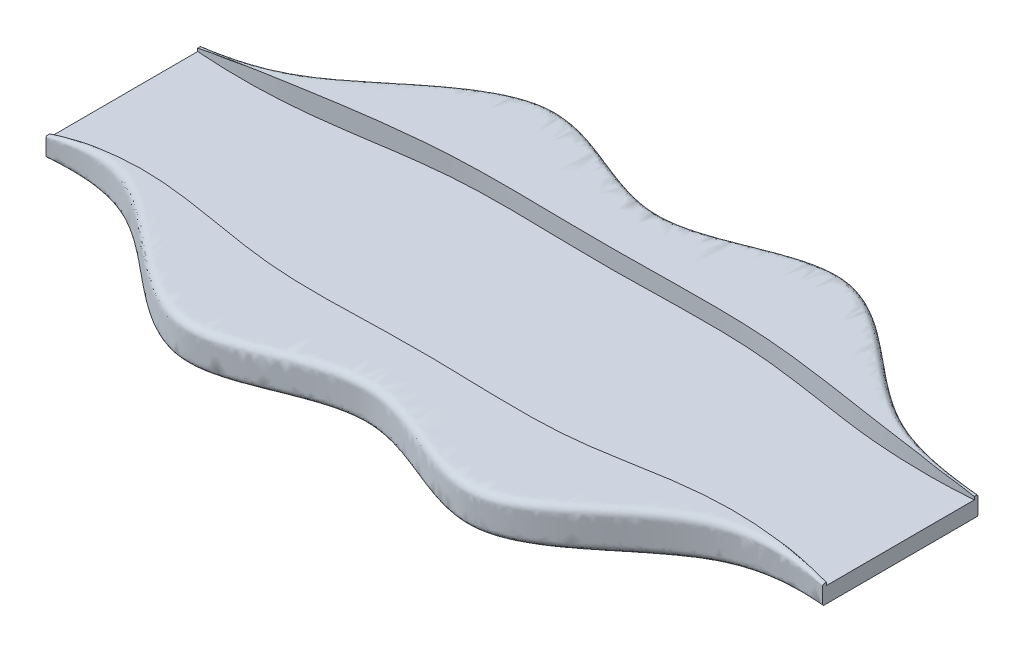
ISO-10303-21;
HEADER;
FILE_DESCRIPTION(('STEP AP214'),'2;1');
FILE_NAME('part.step','',(''),(''),'','','');
FILE_SCHEMA(('AUTOMOTIVE_DESIGN { 1 0 10303 214 1 1 1 1 }'));
ENDSEC;
DATA;
#1=APPLICATION_CONTEXT('core data for automotive mechanical design processes');
#2=APPLICATION_PROTOCOL_DEFINITION('international standard','automotive_design',2000,#1);
#3=PRODUCT_CONTEXT('',#1,'mechanical');
#4=PRODUCT('Part','Part','',(#3));
#5=PRODUCT_RELATED_PRODUCT_CATEGORY('part','',(#4));
#6=PRODUCT_DEFINITION_FORMATION('','',#4);
#7=PRODUCT_DEFINITION_CONTEXT('part definition',#1,'design');
#8=PRODUCT_DEFINITION('design','',#6,#7);
#9=PRODUCT_DEFINITION_SHAPE('','',#8);
#10=(LENGTH_UNIT() NAMED_UNIT(*) SI_UNIT(.MILLI.,.METRE.));
#11=(NAMED_UNIT(*) PLANE_ANGLE_UNIT() SI_UNIT($,.RADIAN.));
#12=(NAMED_UNIT(*) SI_UNIT($,.STERADIAN.) SOLID_ANGLE_UNIT());
#13=UNCERTAINTY_MEASURE_WITH_UNIT(LENGTH_MEASURE(1.E-05),#10,'distance_accuracy_value','');
#14=(GEOMETRIC_REPRESENTATION_CONTEXT(3) GLOBAL_UNCERTAINTY_ASSIGNED_CONTEXT((#13)) GLOBAL_UNIT_ASSIGNED_CONTEXT((#10,
#11,#12)) REPRESENTATION_CONTEXT('',''));
#15=CARTESIAN_POINT('',(0.,0.,0.));
#16=DIRECTION('',(0.,0.,1.));
#17=DIRECTION('',(1.,0.,0.));
#18=AXIS2_PLACEMENT_3D('',#15,#16,#17);
#19=CARTESIAN_POINT('',(66.6749999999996,0.276830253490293,-13.0805367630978));
#20=DIRECTION('',(-1.,0.,0.));
#21=DIRECTION('',(0.,0.,1.));
#22=AXIS2_PLACEMENT_3D('',#19,#20,#21);
#23=PLANE('',#22);
#24=DIRECTION('',(0.,0.999998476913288,0.00174532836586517));
#25=VECTOR('',#24,1.);
#26=CARTESIAN_POINT('',(66.6749999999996,0.48583355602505,12.7008672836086));
#27=LINE('',#26,#25);
#28=CARTESIAN_POINT('',(66.6749999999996,-0.0221656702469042,12.6999806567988));
#29=VERTEX_POINT('',#28);
#30=CARTESIAN_POINT('',(66.6749999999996,0.48583355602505,12.7008672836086));
#31=VERTEX_POINT('',#30);
#32=EDGE_CURVE('E695',#29,#31,#27,.T.);
#33=ORIENTED_EDGE('',*,*,#32,.T.);
#34=DIRECTION('',(0.,-0.00174532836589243,0.999998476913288));
#35=VECTOR('',#34,1.);
#36=CARTESIAN_POINT('',(66.6749999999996,0.485168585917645,13.0818667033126));
#37=LINE('',#36,#35);
#38=CARTESIAN_POINT('',(66.6749999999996,0.485168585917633,13.0818667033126));
#39=VERTEX_POINT('',#38);
#40=EDGE_CURVE('E685',#31,#39,#37,.T.);
#41=ORIENTED_EDGE('',*,*,#40,.T.);
#42=CARTESIAN_POINT('',(66.6749999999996,0.231168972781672,13.0814233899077));
#43=DIRECTION('',(1.,0.,0.));
#44=DIRECTION('',(0.,0.,1.));
#45=AXIS2_PLACEMENT_3D('',#42,#43,#44);
#46=CIRCLE('',#45,0.253999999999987);
#47=CARTESIAN_POINT('',(66.6749999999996,0.230725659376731,13.3354230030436));
#48=VERTEX_POINT('',#47);
#49=EDGE_CURVE('E707',#39,#48,#46,.T.);
#50=ORIENTED_EDGE('',*,*,#49,.T.);
#51=DIRECTION('',(0.,-0.999998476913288,-0.00174532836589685));
#52=VECTOR('',#51,1.);
#53=CARTESIAN_POINT('',(66.6749999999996,-2.4870702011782,13.3306795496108));
#54=LINE('',#53,#52);
#55=CARTESIAN_POINT('',(66.6749999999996,-2.4870702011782,13.3306795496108));
#56=VERTEX_POINT('',#55);
#57=EDGE_CURVE('E777',#48,#56,#54,.T.);
#58=ORIENTED_EDGE('',*,*,#57,.T.);
#59=CARTESIAN_POINT('',(66.6749999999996,-2.48662688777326,13.0766799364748));
#60=DIRECTION('',(1.,0.,0.));
#61=DIRECTION('',(0.,0.,1.));
#62=AXIS2_PLACEMENT_3D('',#59,#60,#61);
#63=CIRCLE('',#62,0.253999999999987);
#64=CARTESIAN_POINT('',(66.6749999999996,-2.74062650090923,13.0762366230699));
#65=VERTEX_POINT('',#64);
#66=EDGE_CURVE('E769',#56,#65,#63,.T.);
#67=ORIENTED_EDGE('',*,*,#66,.T.);
#68=DIRECTION('',(0.,0.00174532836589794,-0.999998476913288));
#69=VECTOR('',#68,1.);
#70=CARTESIAN_POINT('',(66.6749999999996,-2.69496522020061,-13.0857235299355));
#71=LINE('',#70,#69);
#72=CARTESIAN_POINT('',(66.6749999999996,-2.69496522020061,-13.0857235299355));
#73=VERTEX_POINT('',#72);
#74=EDGE_CURVE('E761',#65,#73,#71,.T.);
#75=ORIENTED_EDGE('',*,*,#74,.T.);
#76=CARTESIAN_POINT('',(66.6749999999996,-2.44096560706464,-13.0852802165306));
#77=DIRECTION('',(1.,0.,0.));
#78=DIRECTION('',(0.,0.,1.));
#79=AXIS2_PLACEMENT_3D('',#76,#77,#78);
#80=CIRCLE('',#79,0.253999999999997);
#81=CARTESIAN_POINT('',(66.6749999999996,-2.4405222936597,-13.3392798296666));
#82=VERTEX_POINT('',#81);
#83=EDGE_CURVE('E753',#73,#82,#80,.T.);
#84=ORIENTED_EDGE('',*,*,#83,.T.);
#85=DIRECTION('',(0.,0.999998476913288,0.00174532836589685));
#86=VECTOR('',#85,1.);
#87=CARTESIAN_POINT('',(66.6749999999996,0.27727356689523,-13.3345363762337));
#88=LINE('',#87,#86);
#89=CARTESIAN_POINT('',(66.6749999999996,0.27727356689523,-13.3345363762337));
#90=VERTEX_POINT('',#89);
#91=EDGE_CURVE('E745',#82,#90,#88,.T.);
#92=ORIENTED_EDGE('',*,*,#91,.T.);
#93=CARTESIAN_POINT('',(66.6749999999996,0.276830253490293,-13.0805367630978));
#94=DIRECTION('',(1.,0.,0.));
#95=DIRECTION('',(0.,0.,1.));
#96=AXIS2_PLACEMENT_3D('',#93,#94,#95);
#97=CIRCLE('',#96,0.254000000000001);
#98=CARTESIAN_POINT('',(66.6749999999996,0.530829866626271,-13.0800934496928));
#99=VERTEX_POINT('',#98);
#100=EDGE_CURVE('E737',#90,#99,#97,.T.);
#101=ORIENTED_EDGE('',*,*,#100,.T.);
#102=DIRECTION('',(0.,-0.0017453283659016,0.999998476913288));
#103=VECTOR('',#102,1.);
#104=CARTESIAN_POINT('',(66.6749999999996,0.530164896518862,-12.6990940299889));
#105=LINE('',#104,#103);
#106=CARTESIAN_POINT('',(66.6749999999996,0.530164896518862,-12.6990940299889));
#107=VERTEX_POINT('',#106);
#108=EDGE_CURVE('E729',#99,#107,#105,.T.);
#109=ORIENTED_EDGE('',*,*,#108,.T.);
#110=DIRECTION('',(0.,-0.999998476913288,-0.00174532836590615));
#111=VECTOR('',#110,1.);
#112=CARTESIAN_POINT('',(66.6749999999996,0.0221656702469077,-12.6999806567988));
#113=LINE('',#112,#111);
#114=CARTESIAN_POINT('',(66.6749999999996,0.0221656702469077,-12.6999806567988));
#115=VERTEX_POINT('',#114);
#116=EDGE_CURVE('E719',#107,#115,#113,.T.);
#117=ORIENTED_EDGE('',*,*,#116,.T.);
#118=DIRECTION('',(0.,-0.0017453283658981,0.999998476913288));
#119=VECTOR('',#118,1.);
#120=CARTESIAN_POINT('',(66.6749999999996,-0.0221656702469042,12.6999806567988));
#121=LINE('',#120,#119);
#122=EDGE_CURVE('E713',#115,#29,#121,.T.);
#123=ORIENTED_EDGE('',*,*,#122,.T.);
#124=EDGE_LOOP('',(#33,#41,#50,#58,#67,#75,#84,#92,#101,#109,#117,#123));
#125=FACE_BOUND('',#124,.T.);
#126=ADVANCED_FACE('F598',(#125),#23,.F.);
#127=CARTESIAN_POINT('',(-66.6750000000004,0.276830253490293,-13.0805367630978));
#128=DIRECTION('',(-1.,0.,0.));
#129=DIRECTION('',(0.,0.,1.));
#130=AXIS2_PLACEMENT_3D('',#127,#128,#129);
#131=PLANE('',#130);
#132=DIRECTION('',(0.,0.999998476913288,0.00174532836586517));
#133=VECTOR('',#132,1.);
#134=CARTESIAN_POINT('',(-66.6750000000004,0.48583355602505,12.7008672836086));
#135=LINE('',#134,#133);
#136=CARTESIAN_POINT('',(-66.6750000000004,-0.0221656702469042,12.6999806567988));
#137=VERTEX_POINT('',#136);
#138=CARTESIAN_POINT('',(-66.6750000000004,0.48583355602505,12.7008672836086));
#139=VERTEX_POINT('',#138);
#140=EDGE_CURVE('E698',#137,#139,#135,.T.);
#141=ORIENTED_EDGE('',*,*,#140,.F.);
#142=DIRECTION('',(0.,-0.0017453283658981,0.999998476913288));
#143=VECTOR('',#142,1.);
#144=CARTESIAN_POINT('',(-66.6750000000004,-0.0221656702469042,12.6999806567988));
#145=LINE('',#144,#143);
#146=CARTESIAN_POINT('',(-66.6750000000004,0.0221656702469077,-12.6999806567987));
#147=VERTEX_POINT('',#146);
#148=EDGE_CURVE('E886',#147,#137,#145,.T.);
#149=ORIENTED_EDGE('',*,*,#148,.F.);
#150=DIRECTION('',(0.,-0.999998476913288,-0.00174532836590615));
#151=VECTOR('',#150,1.);
#152=CARTESIAN_POINT('',(-66.6750000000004,0.0221656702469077,-12.6999806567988));
#153=LINE('',#152,#151);
#154=CARTESIAN_POINT('',(-66.6750000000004,0.530164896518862,-12.6990940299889));
#155=VERTEX_POINT('',#154);
#156=EDGE_CURVE('E892',#155,#147,#153,.T.);
#157=ORIENTED_EDGE('',*,*,#156,.F.);
#158=DIRECTION('',(0.,-0.0017453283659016,0.999998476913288));
#159=VECTOR('',#158,1.);
#160=CARTESIAN_POINT('',(-66.6750000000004,0.530164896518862,-12.6990940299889));
#161=LINE('',#160,#159);
#162=CARTESIAN_POINT('',(-66.6750000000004,0.53082986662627,-13.0800934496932));
#163=VERTEX_POINT('',#162);
#164=EDGE_CURVE('E895',#163,#155,#161,.T.);
#165=ORIENTED_EDGE('',*,*,#164,.F.);
#166=CARTESIAN_POINT('',(-66.6750000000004,0.276830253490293,-13.0805367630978));
#167=DIRECTION('',(1.,0.,0.));
#168=DIRECTION('',(0.,0.,1.));
#169=AXIS2_PLACEMENT_3D('',#166,#167,#168);
#170=CIRCLE('',#169,0.254000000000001);
#171=CARTESIAN_POINT('',(-66.6750000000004,0.277273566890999,-13.3345363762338));
#172=VERTEX_POINT('',#171);
#173=EDGE_CURVE('E999',#172,#163,#170,.T.);
#174=ORIENTED_EDGE('',*,*,#173,.F.);
#175=DIRECTION('',(0.,0.999998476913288,0.00174532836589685));
#176=VECTOR('',#175,1.);
#177=CARTESIAN_POINT('',(-66.6750000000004,0.27727356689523,-13.3345363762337));
#178=LINE('',#177,#176);
#179=CARTESIAN_POINT('',(-66.6750000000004,-2.44052229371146,-13.3392798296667));
#180=VERTEX_POINT('',#179);
#181=EDGE_CURVE('E995',#180,#172,#178,.T.);
#182=ORIENTED_EDGE('',*,*,#181,.F.);
#183=CARTESIAN_POINT('',(-66.6750000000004,-2.44096560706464,-13.0852802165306));
#184=DIRECTION('',(1.,0.,0.));
#185=DIRECTION('',(0.,0.,1.));
#186=AXIS2_PLACEMENT_3D('',#183,#184,#185);
#187=CIRCLE('',#186,0.253999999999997);
#188=CARTESIAN_POINT('',(-66.6750000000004,-2.69496522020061,-13.0857235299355));
#189=VERTEX_POINT('',#188);
#190=EDGE_CURVE('E991',#189,#180,#187,.T.);
#191=ORIENTED_EDGE('',*,*,#190,.F.);
#192=DIRECTION('',(0.,0.00174532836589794,-0.999998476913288));
#193=VECTOR('',#192,1.);
#194=CARTESIAN_POINT('',(-66.6750000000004,-2.69496522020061,-13.0857235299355));
#195=LINE('',#194,#193);
#196=CARTESIAN_POINT('',(-66.6750000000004,-2.74062650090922,13.0762366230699));
#197=VERTEX_POINT('',#196);
#198=EDGE_CURVE('E987',#197,#189,#195,.T.);
#199=ORIENTED_EDGE('',*,*,#198,.F.);
#200=CARTESIAN_POINT('',(-66.6750000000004,-2.48662688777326,13.0766799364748));
#201=DIRECTION('',(1.,0.,0.));
#202=DIRECTION('',(0.,0.,1.));
#203=AXIS2_PLACEMENT_3D('',#200,#201,#202);
#204=CIRCLE('',#203,0.253999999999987);
#205=CARTESIAN_POINT('',(-66.6750000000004,-2.48707020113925,13.3306795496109));
#206=VERTEX_POINT('',#205);
#207=EDGE_CURVE('E981',#206,#197,#204,.T.);
#208=ORIENTED_EDGE('',*,*,#207,.F.);
#209=DIRECTION('',(0.,-0.999998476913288,-0.00174532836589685));
#210=VECTOR('',#209,1.);
#211=CARTESIAN_POINT('',(-66.6750000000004,-2.4870702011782,13.3306795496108));
#212=LINE('',#211,#210);
#213=CARTESIAN_POINT('',(-66.6750000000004,0.230725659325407,13.3354230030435));
#214=VERTEX_POINT('',#213);
#215=EDGE_CURVE('E979',#214,#206,#212,.T.);
#216=ORIENTED_EDGE('',*,*,#215,.F.);
#217=CARTESIAN_POINT('',(-66.6750000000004,0.231168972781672,13.0814233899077));
#218=DIRECTION('',(1.,0.,0.));
#219=DIRECTION('',(0.,0.,1.));
#220=AXIS2_PLACEMENT_3D('',#217,#218,#219);
#221=CIRCLE('',#220,0.253999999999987);
#222=CARTESIAN_POINT('',(-66.6750000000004,0.485168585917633,13.0818667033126));
#223=VERTEX_POINT('',#222);
#224=EDGE_CURVE('E609',#223,#214,#221,.T.);
#225=ORIENTED_EDGE('',*,*,#224,.F.);
#226=DIRECTION('',(0.,-0.00174532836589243,0.999998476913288));
#227=VECTOR('',#226,1.);
#228=CARTESIAN_POINT('',(-66.6750000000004,0.485168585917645,13.0818667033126));
#229=LINE('',#228,#227);
#230=EDGE_CURVE('E12',#139,#223,#229,.T.);
#231=ORIENTED_EDGE('',*,*,#230,.F.);
#232=EDGE_LOOP('',(#141,#149,#157,#165,#174,#182,#191,#199,#208,#216,#225,#231));
#233=FACE_BOUND('',#232,.T.);
#234=ADVANCED_FACE('F806',(#233),#131,.T.);
#235=CARTESIAN_POINT('',(-66.6750000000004,0.0221656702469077,-12.6999806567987));
#236=CARTESIAN_POINT('',(-61.352203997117,0.024990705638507,-12.2953214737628));
#237=CARTESIAN_POINT('',(-46.2640245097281,0.0248016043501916,-12.3224084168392));
#238=CARTESIAN_POINT('',(-26.9710231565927,-0.0079289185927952,-17.0107414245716));
#239=CARTESIAN_POINT('',(-1.57508779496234E-13,0.00379036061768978,-15.33206725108));
#240=CARTESIAN_POINT('',(26.9710231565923,-0.00792891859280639,-17.0107414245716));
#241=CARTESIAN_POINT('',(46.2640245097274,0.0248016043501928,-12.3224084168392));
#242=CARTESIAN_POINT('',(61.3522039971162,0.0249907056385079,-12.2953214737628));
#243=CARTESIAN_POINT('',(66.6749999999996,0.0221656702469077,-12.6999806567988));
#244=CARTESIAN_POINT('',(-66.6750000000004,0.00738855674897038,-4.23332688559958));
#245=CARTESIAN_POINT('',(-61.352203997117,0.00833023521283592,-4.09844049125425));
#246=CARTESIAN_POINT('',(-46.2640245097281,0.0082672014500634,-4.10746947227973));
#247=CARTESIAN_POINT('',(-26.9710231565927,-0.0026429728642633,-5.67024714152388));
#248=CARTESIAN_POINT('',(-1.57508779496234E-13,0.00126345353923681,-5.11068908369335));
#249=CARTESIAN_POINT('',(26.9710231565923,-0.00264297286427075,-5.67024714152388));
#250=CARTESIAN_POINT('',(46.2640245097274,0.00826720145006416,-4.10746947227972));
#251=CARTESIAN_POINT('',(61.3522039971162,0.00833023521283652,-4.09844049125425));
#252=CARTESIAN_POINT('',(66.6749999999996,0.00738855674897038,-4.23332688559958));
#253=CARTESIAN_POINT('',(-66.6750000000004,-0.00738855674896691,4.23332688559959));
#254=CARTESIAN_POINT('',(-61.352203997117,-0.0083302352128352,4.09844049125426));
#255=CARTESIAN_POINT('',(-46.2640245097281,-0.00826720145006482,4.10746947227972));
#256=CARTESIAN_POINT('',(-26.9710231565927,0.00264297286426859,5.67024714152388));
#257=CARTESIAN_POINT('',(-1.57508779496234E-13,-0.00126345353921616,5.11068908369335));
#258=CARTESIAN_POINT('',(26.9710231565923,0.00264297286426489,5.67024714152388));
#259=CARTESIAN_POINT('',(46.2640245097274,-0.00826720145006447,4.10746947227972));
#260=CARTESIAN_POINT('',(61.3522039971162,-0.00833023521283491,4.09844049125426));
#261=CARTESIAN_POINT('',(66.6749999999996,-0.00738855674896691,4.23332688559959));
#262=CARTESIAN_POINT('',(-66.6750000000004,-0.0221656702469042,12.6999806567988));
#263=CARTESIAN_POINT('',(-61.352203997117,-0.0249907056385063,12.2953214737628));
#264=CARTESIAN_POINT('',(-46.2640245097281,-0.024801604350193,12.3224084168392));
#265=CARTESIAN_POINT('',(-26.9710231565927,0.00792891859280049,17.0107414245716));
#266=CARTESIAN_POINT('',(-1.57508779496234E-13,-0.00379036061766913,15.33206725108));
#267=CARTESIAN_POINT('',(26.9710231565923,0.00792891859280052,17.0107414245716));
#268=CARTESIAN_POINT('',(46.2640245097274,-0.0248016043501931,12.3224084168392));
#269=CARTESIAN_POINT('',(61.3522039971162,-0.0249907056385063,12.2953214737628));
#270=CARTESIAN_POINT('',(66.6749999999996,-0.0221656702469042,12.6999806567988));
#271=B_SPLINE_SURFACE_WITH_KNOTS('',3,3,((#235,#236,#237,#238,#239,#240,#241,#242,#243),(#244,
#245,#246,#247,#248,#249,#250,#251,#252),(#253,#254,#255,#256,#257,#258,#259,#260,#261),(#262,
#263,#264,#265,#266,#267,#268,#269,#270)),.UNSPECIFIED.,.F.,.F.,.F.,(4,4),(4,1,1,1,1,1,4),(0.,
1.),(0.,0.114373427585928,0.315654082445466,0.500000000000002,0.684345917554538,
0.885626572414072,1.),.UNSPECIFIED.);
#272=CARTESIAN_POINT('',(-66.6750000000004,-0.0221656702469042,12.6999806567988));
#273=CARTESIAN_POINT('',(-61.352203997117,-0.0249907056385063,12.2953214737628));
#274=CARTESIAN_POINT('',(-46.2640245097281,-0.024801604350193,12.3224084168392));
#275=CARTESIAN_POINT('',(-26.9710231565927,0.00792891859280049,17.0107414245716));
#276=CARTESIAN_POINT('',(-1.57508779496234E-13,-0.00379036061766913,15.33206725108));
#277=CARTESIAN_POINT('',(26.9710231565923,0.00792891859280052,17.0107414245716));
#278=CARTESIAN_POINT('',(46.2640245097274,-0.0248016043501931,12.3224084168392));
#279=CARTESIAN_POINT('',(61.3522039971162,-0.0249907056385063,12.2953214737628));
#280=CARTESIAN_POINT('',(66.6749999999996,-0.0221656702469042,12.6999806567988));
#281=B_SPLINE_CURVE_WITH_KNOTS('',3,(#272,#273,#274,#275,#276,#277,#278,#279,#280),
.UNSPECIFIED.,.F.,.F.,(4,1,1,1,1,1,4),(0.,0.114373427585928,0.315654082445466,0.500000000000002,
0.684345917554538,0.885626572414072,1.),.UNSPECIFIED.);
#282=EDGE_CURVE('E914',#137,#29,#281,.T.);
#283=CARTESIAN_POINT('',(-66.6750000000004,0.0221656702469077,-12.6999806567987));
#284=CARTESIAN_POINT('',(-61.352203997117,0.024990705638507,-12.2953214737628));
#285=CARTESIAN_POINT('',(-46.2640245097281,0.0248016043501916,-12.3224084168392));
#286=CARTESIAN_POINT('',(-26.9710231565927,-0.0079289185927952,-17.0107414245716));
#287=CARTESIAN_POINT('',(-1.57508779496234E-13,0.00379036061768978,-15.33206725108));
#288=CARTESIAN_POINT('',(26.9710231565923,-0.00792891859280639,-17.0107414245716));
#289=CARTESIAN_POINT('',(46.2640245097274,0.0248016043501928,-12.3224084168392));
#290=CARTESIAN_POINT('',(61.3522039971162,0.0249907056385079,-12.2953214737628));
#291=CARTESIAN_POINT('',(66.6749999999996,0.0221656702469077,-12.6999806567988));
#292=B_SPLINE_CURVE_WITH_KNOTS('',3,(#283,#284,#285,#286,#287,#288,#289,#290,#291),
.UNSPECIFIED.,.F.,.F.,(4,1,1,1,1,1,4),(0.,0.114373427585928,0.315654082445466,0.500000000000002,
0.684345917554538,0.885626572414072,1.),.UNSPECIFIED.);
#293=EDGE_CURVE('E701',#115,#147,#292,.F.);
#294=ORIENTED_EDGE('',*,*,#148,.T.);
#295=ORIENTED_EDGE('',*,*,#282,.T.);
#296=ORIENTED_EDGE('',*,*,#122,.F.);
#297=ORIENTED_EDGE('',*,*,#293,.T.);
#298=EDGE_LOOP('',(#294,#295,#296,#297));
#299=FACE_BOUND('',#298,.T.);
#300=ADVANCED_FACE('F815',(#299),#271,.T.);
#301=CARTESIAN_POINT('',(-66.6750000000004,-0.0221656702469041,12.6999806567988));
#302=CARTESIAN_POINT('',(-61.352203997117,-0.0249907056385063,12.2953214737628));
#303=CARTESIAN_POINT('',(-46.2640245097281,-0.024801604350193,12.3224084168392));
#304=CARTESIAN_POINT('',(-26.9710231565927,0.00792891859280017,17.0107414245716));
#305=CARTESIAN_POINT('',(-1.57508779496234E-13,-0.00379036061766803,15.33206725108));
#306=CARTESIAN_POINT('',(26.9710231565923,0.0079289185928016,17.0107414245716));
#307=CARTESIAN_POINT('',(46.2640245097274,-0.0248016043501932,12.3224084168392));
#308=CARTESIAN_POINT('',(61.3522039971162,-0.0249907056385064,12.2953214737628));
#309=CARTESIAN_POINT('',(66.6749999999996,-0.0221656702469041,12.6999806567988));
#310=CARTESIAN_POINT('',(-66.6750000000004,0.147167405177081,12.7002761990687));
#311=CARTESIAN_POINT('',(-61.3639937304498,0.622936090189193,12.2957824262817));
#312=CARTESIAN_POINT('',(-46.2541941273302,1.37831057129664,12.3258375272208));
#313=CARTESIAN_POINT('',(-26.9737327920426,0.956038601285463,17.0096451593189));
#314=CARTESIAN_POINT('',(-1.57508779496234E-13,1.10723456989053,15.3325913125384));
#315=CARTESIAN_POINT('',(26.9737327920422,0.956038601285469,17.0096451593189));
#316=CARTESIAN_POINT('',(46.2541941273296,1.37831057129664,12.3258375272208));
#317=CARTESIAN_POINT('',(61.3639937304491,0.622936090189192,12.2957824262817));
#318=CARTESIAN_POINT('',(66.6749999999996,0.147167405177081,12.7002761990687));
#319=CARTESIAN_POINT('',(-66.6750000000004,0.316500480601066,12.7005717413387));
#320=CARTESIAN_POINT('',(-61.3757834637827,1.27086288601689,12.2962433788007));
#321=CARTESIAN_POINT('',(-46.2443637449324,2.78142274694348,12.3292666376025));
#322=CARTESIAN_POINT('',(-26.9764424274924,1.90414828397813,17.0085488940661));
#323=CARTESIAN_POINT('',(-1.58890435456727E-13,2.21825950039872,15.3331153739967));
#324=CARTESIAN_POINT('',(26.9764424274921,1.90414828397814,17.0085488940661));
#325=CARTESIAN_POINT('',(46.2443637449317,2.78142274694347,12.3292666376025));
#326=CARTESIAN_POINT('',(61.3757834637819,1.27086288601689,12.2962433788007));
#327=CARTESIAN_POINT('',(66.6749999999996,0.316500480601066,12.7005717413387));
#328=CARTESIAN_POINT('',(-66.6750000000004,0.48583355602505,12.7008672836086));
#329=CARTESIAN_POINT('',(-61.3875731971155,1.91878968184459,12.2967043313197));
#330=CARTESIAN_POINT('',(-46.2345333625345,4.18453492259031,12.3326957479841));
#331=CARTESIAN_POINT('',(-26.9791520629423,2.85225796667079,17.0074526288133));
#332=CARTESIAN_POINT('',(-1.58890435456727E-13,3.32928443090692,15.333639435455));
#333=CARTESIAN_POINT('',(26.9791520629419,2.8522579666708,17.0074526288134));
#334=CARTESIAN_POINT('',(46.2345333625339,4.1845349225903,12.3326957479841));
#335=CARTESIAN_POINT('',(61.3875731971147,1.91878968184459,12.2967043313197));
#336=CARTESIAN_POINT('',(66.6749999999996,0.48583355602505,12.7008672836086));
#337=B_SPLINE_SURFACE_WITH_KNOTS('',3,3,((#301,#302,#303,#304,#305,#306,#307,#308,#309),(#310,
#311,#312,#313,#314,#315,#316,#317,#318),(#319,#320,#321,#322,#323,#324,#325,#326,#327),(#328,
#329,#330,#331,#332,#333,#334,#335,#336)),.UNSPECIFIED.,.F.,.F.,.F.,(4,4),(4,1,1,1,1,1,4),(0.,
1.),(0.,0.114373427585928,0.315654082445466,0.500000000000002,0.684345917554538,
0.885626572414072,1.),.UNSPECIFIED.);
#338=CARTESIAN_POINT('',(-66.6750000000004,0.48583355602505,12.7008672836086));
#339=CARTESIAN_POINT('',(-61.3875731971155,1.91878968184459,12.2967043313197));
#340=CARTESIAN_POINT('',(-46.2345333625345,4.18453492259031,12.3326957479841));
#341=CARTESIAN_POINT('',(-26.9791520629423,2.85225796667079,17.0074526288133));
#342=CARTESIAN_POINT('',(-1.58890435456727E-13,3.32928443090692,15.333639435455));
#343=CARTESIAN_POINT('',(26.9791520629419,2.8522579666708,17.0074526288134));
#344=CARTESIAN_POINT('',(46.2345333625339,4.1845349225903,12.3326957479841));
#345=CARTESIAN_POINT('',(61.3875731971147,1.91878968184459,12.2967043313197));
#346=CARTESIAN_POINT('',(66.6749999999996,0.48583355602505,12.7008672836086));
#347=B_SPLINE_CURVE_WITH_KNOTS('',3,(#338,#339,#340,#341,#342,#343,#344,#345,#346),
.UNSPECIFIED.,.F.,.F.,(4,1,1,1,1,1,4),(0.,0.114373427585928,0.315654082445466,0.500000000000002,
0.684345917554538,0.885626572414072,1.),.UNSPECIFIED.);
#348=EDGE_CURVE('E692',#139,#31,#347,.T.);
#349=ORIENTED_EDGE('',*,*,#140,.T.);
#350=ORIENTED_EDGE('',*,*,#348,.T.);
#351=ORIENTED_EDGE('',*,*,#32,.F.);
#352=ORIENTED_EDGE('',*,*,#282,.F.);
#353=EDGE_LOOP('',(#349,#350,#351,#352));
#354=FACE_BOUND('',#353,.T.);
#355=ADVANCED_FACE('F693',(#354),#337,.T.);
#356=CARTESIAN_POINT('',(-66.6750000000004,0.530164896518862,-12.6990940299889));
#357=CARTESIAN_POINT('',(-61.3870846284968,1.96884038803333,-12.2885347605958));
#358=CARTESIAN_POINT('',(-46.2349407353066,4.23407991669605,-12.3166608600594));
#359=CARTESIAN_POINT('',(-26.9790397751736,2.83641874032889,-17.0125788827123));
#360=CARTESIAN_POINT('',(-1.6027209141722E-13,3.33685625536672,-15.3311888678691));
#361=CARTESIAN_POINT('',(26.9790397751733,2.8364187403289,-17.0125788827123));
#362=CARTESIAN_POINT('',(46.234940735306,4.23407991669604,-12.3166608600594));
#363=CARTESIAN_POINT('',(61.387084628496,1.96884038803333,-12.2885347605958));
#364=CARTESIAN_POINT('',(66.6749999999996,0.530164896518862,-12.6990940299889));
#365=CARTESIAN_POINT('',(-66.6750000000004,0.360831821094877,-12.6993895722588));
#366=CARTESIAN_POINT('',(-61.3754577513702,1.32089049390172,-12.2907969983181));
#367=CARTESIAN_POINT('',(-46.2446353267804,2.8309871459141,-12.3185767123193));
#368=CARTESIAN_POINT('',(-26.97636756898,1.88830285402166,-17.0119663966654));
#369=CARTESIAN_POINT('',(-1.57508779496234E-13,2.22583429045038,-15.3314816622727));
#370=CARTESIAN_POINT('',(26.9763675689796,1.88830285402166,-17.0119663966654));
#371=CARTESIAN_POINT('',(46.2446353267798,2.83098714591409,-12.3185767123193));
#372=CARTESIAN_POINT('',(61.3754577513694,1.32089049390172,-12.2907969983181));
#373=CARTESIAN_POINT('',(66.6749999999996,0.360831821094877,-12.6993895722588));
#374=CARTESIAN_POINT('',(-66.6750000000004,0.191498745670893,-12.6996851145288));
#375=CARTESIAN_POINT('',(-61.3638308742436,0.672940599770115,-12.2930592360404));
#376=CARTESIAN_POINT('',(-46.2543299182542,1.42789437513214,-12.3204925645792));
#377=CARTESIAN_POINT('',(-26.9736953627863,0.940186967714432,-17.0113539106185));
#378=CARTESIAN_POINT('',(-1.6027209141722E-13,1.11481232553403,-15.3317744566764));
#379=CARTESIAN_POINT('',(26.973695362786,0.940186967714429,-17.0113539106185));
#380=CARTESIAN_POINT('',(46.2543299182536,1.42789437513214,-12.3204925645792));
#381=CARTESIAN_POINT('',(61.3638308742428,0.672940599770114,-12.2930592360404));
#382=CARTESIAN_POINT('',(66.6749999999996,0.191498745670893,-12.6996851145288));
#383=CARTESIAN_POINT('',(-66.6750000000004,0.0221656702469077,-12.6999806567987));
#384=CARTESIAN_POINT('',(-61.352203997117,0.024990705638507,-12.2953214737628));
#385=CARTESIAN_POINT('',(-46.2640245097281,0.0248016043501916,-12.3224084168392));
#386=CARTESIAN_POINT('',(-26.9710231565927,-0.0079289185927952,-17.0107414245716));
#387=CARTESIAN_POINT('',(-1.57508779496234E-13,0.00379036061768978,-15.33206725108));
#388=CARTESIAN_POINT('',(26.9710231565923,-0.00792891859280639,-17.0107414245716));
#389=CARTESIAN_POINT('',(46.2640245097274,0.0248016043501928,-12.3224084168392));
#390=CARTESIAN_POINT('',(61.3522039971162,0.0249907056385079,-12.2953214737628));
#391=CARTESIAN_POINT('',(66.6749999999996,0.0221656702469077,-12.6999806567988));
#392=B_SPLINE_SURFACE_WITH_KNOTS('',3,3,((#356,#357,#358,#359,#360,#361,#362,#363,#364),(#365,
#366,#367,#368,#369,#370,#371,#372,#373),(#374,#375,#376,#377,#378,#379,#380,#381,#382),(#383,
#384,#385,#386,#387,#388,#389,#390,#391)),.UNSPECIFIED.,.F.,.F.,.F.,(4,4),(4,1,1,1,1,1,4),(0.,
1.),(0.,0.114373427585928,0.315654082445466,0.500000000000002,0.684345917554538,
0.885626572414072,1.),.UNSPECIFIED.);
#393=CARTESIAN_POINT('',(-66.6750000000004,0.530164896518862,-12.6990940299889));
#394=CARTESIAN_POINT('',(-61.3870846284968,1.96884038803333,-12.2885347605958));
#395=CARTESIAN_POINT('',(-46.2349407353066,4.23407991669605,-12.3166608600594));
#396=CARTESIAN_POINT('',(-26.9790397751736,2.83641874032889,-17.0125788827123));
#397=CARTESIAN_POINT('',(-1.58890435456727E-13,3.33685625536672,-15.3311888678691));
#398=CARTESIAN_POINT('',(26.9790397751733,2.8364187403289,-17.0125788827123));
#399=CARTESIAN_POINT('',(46.234940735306,4.23407991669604,-12.3166608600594));
#400=CARTESIAN_POINT('',(61.387084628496,1.96884038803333,-12.2885347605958));
#401=CARTESIAN_POINT('',(66.6749999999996,0.530164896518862,-12.6990940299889));
#402=B_SPLINE_CURVE_WITH_KNOTS('',3,(#393,#394,#395,#396,#397,#398,#399,#400,#401),
.UNSPECIFIED.,.F.,.F.,(4,1,1,1,1,1,4),(0.,0.114373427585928,0.315654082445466,0.500000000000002,
0.684345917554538,0.885626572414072,1.),.UNSPECIFIED.);
#403=EDGE_CURVE('E702',#155,#107,#402,.T.);
#404=ORIENTED_EDGE('',*,*,#156,.T.);
#405=ORIENTED_EDGE('',*,*,#293,.F.);
#406=ORIENTED_EDGE('',*,*,#116,.F.);
#407=ORIENTED_EDGE('',*,*,#403,.F.);
#408=EDGE_LOOP('',(#404,#405,#406,#407));
#409=FACE_BOUND('',#408,.T.);
#410=ADVANCED_FACE('F906',(#409),#392,.T.);
#411=CARTESIAN_POINT('',(-66.6750000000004,0.48583355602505,12.7008672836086));
#412=CARTESIAN_POINT('',(-61.3875731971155,1.91878968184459,12.2967043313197));
#413=CARTESIAN_POINT('',(-46.2345333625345,4.18453492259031,12.3326957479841));
#414=CARTESIAN_POINT('',(-26.9791520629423,2.85225796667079,17.0074526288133));
#415=CARTESIAN_POINT('',(-1.5612712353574E-13,3.32928443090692,15.333639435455));
#416=CARTESIAN_POINT('',(26.9791520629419,2.8522579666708,17.0074526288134));
#417=CARTESIAN_POINT('',(46.2345333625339,4.1845349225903,12.3326957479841));
#418=CARTESIAN_POINT('',(61.3875731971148,1.91878968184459,12.2967043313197));
#419=CARTESIAN_POINT('',(66.6749999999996,0.48583355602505,12.7008672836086));
#420=CARTESIAN_POINT('',(-66.6750000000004,0.485778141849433,12.7326172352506));
#421=CARTESIAN_POINT('',(-61.3615332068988,1.92031674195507,12.2563763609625));
#422=CARTESIAN_POINT('',(-46.25624573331,4.18267958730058,12.3747364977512));
#423=CARTESIAN_POINT('',(-26.9731672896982,2.85285110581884,18.8616867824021));
#424=CARTESIAN_POINT('',(-1.5612712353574E-13,3.3290008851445,15.4640066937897));
#425=CARTESIAN_POINT('',(26.9731672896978,2.85285110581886,18.8616867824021));
#426=CARTESIAN_POINT('',(46.2562457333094,4.18267958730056,12.3747364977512));
#427=CARTESIAN_POINT('',(61.361533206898,1.92031674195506,12.2563763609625));
#428=CARTESIAN_POINT('',(66.6749999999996,0.485778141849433,12.7326172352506));
#429=CARTESIAN_POINT('',(-66.6750000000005,0.485675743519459,12.7912870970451));
#430=CARTESIAN_POINT('',(-61.3094532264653,1.92337929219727,12.1708903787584));
#431=CARTESIAN_POINT('',(-46.2996704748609,4.17904892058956,12.3826260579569));
#432=CARTESIAN_POINT('',(-26.96119774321,2.854011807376,22.7717629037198));
#433=CARTESIAN_POINT('',(-1.54745467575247E-13,3.32844602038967,15.6621559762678));
#434=CARTESIAN_POINT('',(26.9611977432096,2.85401180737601,22.7717629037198));
#435=CARTESIAN_POINT('',(46.2996704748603,4.17904892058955,12.3826260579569));
#436=CARTESIAN_POINT('',(61.3094532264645,1.92337929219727,12.1708903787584));
#437=CARTESIAN_POINT('',(66.6749999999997,0.485675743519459,12.7912870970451));
#438=CARTESIAN_POINT('',(-66.6750000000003,0.485530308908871,12.8746149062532));
#439=CARTESIAN_POINT('',(-61.1491556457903,1.93276746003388,12.0282544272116));
#440=CARTESIAN_POINT('',(-46.4333279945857,4.1696595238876,12.3332753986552));
#441=CARTESIAN_POINT('',(-26.9243565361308,2.8570135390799,28.8022691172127));
#442=CARTESIAN_POINT('',(-1.65798715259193E-13,3.32701106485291,15.9066043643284));
#443=CARTESIAN_POINT('',(26.9243565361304,2.85701353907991,28.8022691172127));
#444=CARTESIAN_POINT('',(46.433327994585,4.16965952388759,12.3332753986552));
#445=CARTESIAN_POINT('',(61.1491556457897,1.93276746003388,12.0282544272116));
#446=CARTESIAN_POINT('',(66.6749999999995,0.485530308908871,12.8746149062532));
#447=CARTESIAN_POINT('',(-66.6750000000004,0.485372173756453,12.9652195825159));
#448=CARTESIAN_POINT('',(-60.9697418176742,1.94579295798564,11.9911417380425));
#449=CARTESIAN_POINT('',(-46.5829248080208,4.157083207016,12.3295539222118));
#450=CARTESIAN_POINT('',(-26.8831218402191,2.86103410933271,34.4730343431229));
#451=CARTESIAN_POINT('',(-1.46455531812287E-13,3.3250890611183,16.2668605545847));
#452=CARTESIAN_POINT('',(26.8831218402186,2.86103410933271,34.4730343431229));
#453=CARTESIAN_POINT('',(46.5829248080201,4.15708320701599,12.3295539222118));
#454=CARTESIAN_POINT('',(60.9697418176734,1.94579295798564,11.9911417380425));
#455=CARTESIAN_POINT('',(66.6749999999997,0.485372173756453,12.9652195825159));
#456=CARTESIAN_POINT('',(-66.6750000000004,0.485254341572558,13.0327323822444));
#457=CARTESIAN_POINT('',(-60.8392686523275,1.9490303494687,12.0179013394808));
#458=CARTESIAN_POINT('',(-46.6917144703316,4.15314621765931,12.4274425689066));
#459=CARTESIAN_POINT('',(-26.8531351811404,2.86229274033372,37.8115784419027));
#460=CARTESIAN_POINT('',(-1.74088651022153E-13,3.3244873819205,16.6352725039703));
#461=CARTESIAN_POINT('',(26.8531351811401,2.86229274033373,37.8115784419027));
#462=CARTESIAN_POINT('',(46.6917144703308,4.15314621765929,12.4274425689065));
#463=CARTESIAN_POINT('',(60.839268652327,1.94903034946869,12.0179013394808));
#464=CARTESIAN_POINT('',(66.6749999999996,0.485254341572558,13.0327323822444));
#465=CARTESIAN_POINT('',(-66.6750000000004,0.48516166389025,13.0858327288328));
#466=CARTESIAN_POINT('',(-60.7963150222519,1.95503713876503,12.1244852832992));
#467=CARTESIAN_POINT('',(-46.72752958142,4.14714251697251,12.5944752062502));
#468=CARTESIAN_POINT('',(-26.8432631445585,2.86421208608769,39.4632021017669));
#469=CARTESIAN_POINT('',(-1.61653747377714E-13,3.32356985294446,16.8771099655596));
#470=CARTESIAN_POINT('',(26.8432631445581,2.8642120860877,39.4632021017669));
#471=CARTESIAN_POINT('',(46.7275295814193,4.1471425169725,12.5944752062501));
#472=CARTESIAN_POINT('',(60.7963150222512,1.95503713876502,12.1244852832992));
#473=CARTESIAN_POINT('',(66.6749999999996,0.48516166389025,13.0858327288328));
#474=CARTESIAN_POINT('',(-66.6750000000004,0.485089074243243,13.0939131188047));
#475=CARTESIAN_POINT('',(-60.7902308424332,1.95592736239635,12.1414653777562));
#476=CARTESIAN_POINT('',(-46.7326026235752,4.14804442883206,12.6337129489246));
#477=CARTESIAN_POINT('',(-26.8418648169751,2.83944410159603,39.648992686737));
#478=CARTESIAN_POINT('',(-1.63035403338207E-13,3.32600480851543,16.9391548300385));
#479=CARTESIAN_POINT('',(26.8418648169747,2.83944410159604,39.6489926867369));
#480=CARTESIAN_POINT('',(46.7326026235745,4.14804442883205,12.6337129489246));
#481=CARTESIAN_POINT('',(60.7902308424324,1.95592736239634,12.1414653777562));
#482=CARTESIAN_POINT('',(66.6749999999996,0.485089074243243,13.0939131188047));
#483=CARTESIAN_POINT('',(-66.6750000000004,0.484474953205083,13.1065832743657));
#484=CARTESIAN_POINT('',(-60.7864494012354,1.95694287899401,12.1787551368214));
#485=CARTESIAN_POINT('',(-46.7357556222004,4.14593302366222,12.7124370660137));
#486=CARTESIAN_POINT('',(-26.8409957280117,2.77704655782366,39.8550161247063));
#487=CARTESIAN_POINT('',(-1.63035403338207E-13,3.31645362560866,17.0558649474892));
#488=CARTESIAN_POINT('',(26.8409957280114,2.77704655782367,39.8550161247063));
#489=CARTESIAN_POINT('',(46.7357556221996,4.1459330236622,12.7124370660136));
#490=CARTESIAN_POINT('',(60.7864494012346,1.95694287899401,12.1787551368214));
#491=CARTESIAN_POINT('',(66.6749999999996,0.484474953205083,13.1065832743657));
#492=CARTESIAN_POINT('',(-66.6750000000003,0.483026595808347,13.119907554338));
#493=CARTESIAN_POINT('',(-60.7851765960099,1.95572858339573,12.2239545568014));
#494=CARTESIAN_POINT('',(-46.7368168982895,4.13923402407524,12.8124466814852));
#495=CARTESIAN_POINT('',(-26.8407031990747,2.69957170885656,40.0097280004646));
#496=CARTESIAN_POINT('',(-1.49218843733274E-13,3.29178147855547,17.184536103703));
#497=CARTESIAN_POINT('',(26.8407031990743,2.69957170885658,40.0097280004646));
#498=CARTESIAN_POINT('',(46.7368168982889,4.13923402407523,12.8124466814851));
#499=CARTESIAN_POINT('',(60.7851765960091,1.95572858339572,12.2239545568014));
#500=CARTESIAN_POINT('',(66.6749999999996,0.483026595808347,13.119907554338));
#501=CARTESIAN_POINT('',(-66.6750000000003,0.479544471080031,13.1386848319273));
#502=CARTESIAN_POINT('',(-60.7877932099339,1.94504515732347,12.3006422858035));
#503=CARTESIAN_POINT('',(-46.7346351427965,4.11061249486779,12.9841792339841));
#504=CARTESIAN_POINT('',(-26.8413045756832,2.5895046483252,40.1653806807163));
#505=CARTESIAN_POINT('',(-1.85141898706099E-13,3.23627359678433,17.3615765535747));
#506=CARTESIAN_POINT('',(26.8413045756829,2.58950464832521,40.1653806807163));
#507=CARTESIAN_POINT('',(46.7346351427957,4.11061249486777,12.984179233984));
#508=CARTESIAN_POINT('',(60.7877932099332,1.94504515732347,12.3006422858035));
#509=CARTESIAN_POINT('',(66.6749999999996,0.479544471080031,13.1386848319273));
#510=CARTESIAN_POINT('',(-66.6750000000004,0.471461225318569,13.1643145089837));
#511=CARTESIAN_POINT('',(-60.8001068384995,1.90322702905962,12.4364390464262));
#512=CARTESIAN_POINT('',(-46.724367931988,4.01431481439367,13.2950230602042));
#513=CARTESIAN_POINT('',(-26.8441346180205,2.45309754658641,40.2740163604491));
#514=CARTESIAN_POINT('',(-1.43692219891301E-13,3.1252223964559,17.5851594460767));
#515=CARTESIAN_POINT('',(26.84413461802,2.45309754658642,40.274016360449));
#516=CARTESIAN_POINT('',(46.7243679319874,4.01431481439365,13.2950230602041));
#517=CARTESIAN_POINT('',(60.8001068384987,1.90322702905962,12.4364390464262));
#518=CARTESIAN_POINT('',(66.6749999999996,0.471461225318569,13.1643145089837));
#519=CARTESIAN_POINT('',(-66.6750000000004,0.45655674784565,13.1981219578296));
#520=CARTESIAN_POINT('',(-60.8157688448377,1.80107222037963,12.5983546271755));
#521=CARTESIAN_POINT('',(-46.7113088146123,3.78461337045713,13.65731483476));
#522=CARTESIAN_POINT('',(-26.8477342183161,2.30834056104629,40.3488133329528));
#523=CARTESIAN_POINT('',(-1.67180371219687E-13,2.93464974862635,17.8164069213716));
#524=CARTESIAN_POINT('',(26.8477342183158,2.3083405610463,40.3488133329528));
#525=CARTESIAN_POINT('',(46.7113088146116,3.78461337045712,13.6573148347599));
#526=CARTESIAN_POINT('',(60.8157688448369,1.80107222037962,12.5983546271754));
#527=CARTESIAN_POINT('',(66.6749999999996,0.45655674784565,13.1981219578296));
#528=CARTESIAN_POINT('',(-66.6750000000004,0.437212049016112,13.2345801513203));
#529=CARTESIAN_POINT('',(-60.8268204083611,1.66828480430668,12.7305777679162));
#530=CARTESIAN_POINT('',(-46.7020939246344,3.48893694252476,13.9374710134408));
#531=CARTESIAN_POINT('',(-26.8502742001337,2.17006535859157,40.402781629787));
#532=CARTESIAN_POINT('',(-1.45073875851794E-13,2.7102223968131,17.9924552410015));
#533=CARTESIAN_POINT('',(26.8502742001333,2.17006535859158,40.4027816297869));
#534=CARTESIAN_POINT('',(46.7020939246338,3.48893694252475,13.9374710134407));
#535=CARTESIAN_POINT('',(60.8268204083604,1.66828480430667,12.7305777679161));
#536=CARTESIAN_POINT('',(66.6749999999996,0.437212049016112,13.2345801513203));
#537=CARTESIAN_POINT('',(-66.6750000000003,0.400228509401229,13.2747656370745));
#538=CARTESIAN_POINT('',(-60.8339201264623,1.49660491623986,12.8370196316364));
#539=CARTESIAN_POINT('',(-46.6961741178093,3.12564429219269,14.1432681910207));
#540=CARTESIAN_POINT('',(-26.8519059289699,2.04107726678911,40.4392822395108));
#541=CARTESIAN_POINT('',(-1.74088651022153E-13,2.46323566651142,18.1143910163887));
#542=CARTESIAN_POINT('',(26.8519059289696,2.04107726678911,40.4392822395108));
#543=CARTESIAN_POINT('',(46.6961741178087,3.12564429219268,14.1432681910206));
#544=CARTESIAN_POINT('',(60.8339201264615,1.49660491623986,12.8370196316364));
#545=CARTESIAN_POINT('',(66.6749999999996,0.40022850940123,13.2747656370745));
#546=CARTESIAN_POINT('',(-66.6750000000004,0.332407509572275,13.3197549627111));
#547=CARTESIAN_POINT('',(-60.8343684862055,1.30381701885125,12.9018726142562));
#548=CARTESIAN_POINT('',(-46.6958002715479,2.76296387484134,14.2360109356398));
#549=CARTESIAN_POINT('',(-26.8520089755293,1.90001405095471,40.4723566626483));
#550=CARTESIAN_POINT('',(-1.35402284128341E-13,2.21653800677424,18.1781951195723));
#551=CARTESIAN_POINT('',(26.8520089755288,1.90001405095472,40.4723566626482));
#552=CARTESIAN_POINT('',(46.6958002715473,2.76296387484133,14.2360109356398));
#553=CARTESIAN_POINT('',(60.8343684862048,1.30381701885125,12.9018726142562));
#554=CARTESIAN_POINT('',(66.6749999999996,0.332407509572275,13.3197549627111));
#555=CARTESIAN_POINT('',(-66.6750000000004,0.267693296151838,13.335487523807));
#556=CARTESIAN_POINT('',(-60.832968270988,1.19376347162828,12.9162024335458));
#557=CARTESIAN_POINT('',(-46.696967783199,2.57195065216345,14.2427815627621));
#558=CARTESIAN_POINT('',(-26.8516871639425,1.78264251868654,40.4849130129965));
#559=CARTESIAN_POINT('',(-1.63035403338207E-13,2.06525708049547,18.1887694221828));
#560=CARTESIAN_POINT('',(26.8516871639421,1.78264251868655,40.4849130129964));
#561=CARTESIAN_POINT('',(46.6969677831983,2.57195065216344,14.242781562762));
#562=CARTESIAN_POINT('',(60.8329682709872,1.19376347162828,12.9162024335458));
#563=CARTESIAN_POINT('',(66.6749999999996,0.267693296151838,13.335487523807));
#564=CARTESIAN_POINT('',(-66.6750000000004,0.0449294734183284,13.3350987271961));
#565=CARTESIAN_POINT('',(-60.8292643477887,0.846496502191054,12.9128593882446));
#566=CARTESIAN_POINT('',(-46.7000561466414,2.10024930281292,14.2440939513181));
#567=CARTESIAN_POINT('',(-26.8508358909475,1.38591288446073,40.4844934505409));
#568=CARTESIAN_POINT('',(-1.57508779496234E-13,1.64168355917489,18.1889699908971));
#569=CARTESIAN_POINT('',(26.8508358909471,1.38591288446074,40.4844934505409));
#570=CARTESIAN_POINT('',(46.7000561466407,2.10024930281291,14.244093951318));
#571=CARTESIAN_POINT('',(60.8292643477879,0.846496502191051,12.9128593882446));
#572=CARTESIAN_POINT('',(66.6749999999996,0.0449294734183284,13.3350987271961));
#573=CARTESIAN_POINT('',(-66.6750000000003,-0.367717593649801,13.3343785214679));
#574=CARTESIAN_POINT('',(-60.8274023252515,0.327628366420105,12.9178765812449));
#575=CARTESIAN_POINT('',(-46.70160871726,1.35101347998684,14.2375565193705));
#576=CARTESIAN_POINT('',(-26.8504079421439,0.77547387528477,40.486583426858));
#577=CARTESIAN_POINT('',(-1.47837187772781E-13,0.981547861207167,18.1879708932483));
#578=CARTESIAN_POINT('',(26.8504079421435,0.775473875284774,40.486583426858));
#579=CARTESIAN_POINT('',(46.7016087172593,1.35101347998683,14.2375565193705));
#580=CARTESIAN_POINT('',(60.8274023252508,0.327628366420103,12.9178765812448));
#581=CARTESIAN_POINT('',(66.6749999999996,-0.367717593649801,13.3343785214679));
#582=CARTESIAN_POINT('',(-66.6750000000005,-1.12817227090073,13.3330512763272));
#583=CARTESIAN_POINT('',(-60.8253672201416,-0.52125964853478,12.9151732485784));
#584=CARTESIAN_POINT('',(-46.7033056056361,0.380664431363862,14.2365284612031));
#585=CARTESIAN_POINT('',(-26.8499402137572,-0.121696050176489,40.4869120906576));
#586=CARTESIAN_POINT('',(-1.80996930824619E-13,0.0581758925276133,18.1878137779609));
#587=CARTESIAN_POINT('',(26.849940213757,-0.121696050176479,40.4869120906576));
#588=CARTESIAN_POINT('',(46.7033056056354,0.380664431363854,14.236528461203));
#589=CARTESIAN_POINT('',(60.8253672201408,-0.521259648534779,12.9151732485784));
#590=CARTESIAN_POINT('',(66.6749999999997,-1.12817227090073,13.3330512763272));
#591=CARTESIAN_POINT('',(-66.6750000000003,-1.88862694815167,13.3317240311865));
#592=CARTESIAN_POINT('',(-60.8236712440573,-1.38609121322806,12.9141917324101));
#593=CARTESIAN_POINT('',(-46.7047197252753,-0.576290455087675,14.2340539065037));
#594=CARTESIAN_POINT('',(-26.8495504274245,-1.02314800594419,40.4877031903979));
#595=CARTESIAN_POINT('',(-1.34020628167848E-13,-0.86314908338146,18.1874355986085));
#596=CARTESIAN_POINT('',(26.849550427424,-1.02314800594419,40.4877031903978));
#597=CARTESIAN_POINT('',(46.7047197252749,-0.576290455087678,14.2340539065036));
#598=CARTESIAN_POINT('',(60.8236712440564,-1.38609121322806,12.9141917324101));
#599=CARTESIAN_POINT('',(66.6749999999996,-1.88862694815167,13.3317240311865));
#600=CARTESIAN_POINT('',(-66.6750000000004,-2.3012740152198,13.3310038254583));
#601=CARTESIAN_POINT('',(-60.8223572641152,-1.87317633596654,12.9152186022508));
#602=CARTESIAN_POINT('',(-46.7058153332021,-1.35222715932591,14.2308687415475));
#603=CARTESIAN_POINT('',(-26.8492484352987,-1.62505090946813,40.4887214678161));
#604=CARTESIAN_POINT('',(-1.74088651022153E-13,-1.52736540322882,18.1869488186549));
#605=CARTESIAN_POINT('',(26.8492484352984,-1.62505090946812,40.488721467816));
#606=CARTESIAN_POINT('',(46.7058153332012,-1.35222715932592,14.2308687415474));
#607=CARTESIAN_POINT('',(60.8223572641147,-1.87317633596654,12.9152186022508));
#608=CARTESIAN_POINT('',(66.6749999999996,-2.3012740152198,13.3310038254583));
#609=CARTESIAN_POINT('',(-66.6750000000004,-2.52403783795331,13.3306150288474));
#610=CARTESIAN_POINT('',(-60.8208743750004,-2.24607053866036,12.9138791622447));
#611=CARTESIAN_POINT('',(-46.707051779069,-1.8023990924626,14.2304979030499));
#612=CARTESIAN_POINT('',(-26.8489076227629,-2.02866336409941,40.4888400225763));
#613=CARTESIAN_POINT('',(-1.6027209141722E-13,-1.94764864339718,18.1868921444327));
#614=CARTESIAN_POINT('',(26.8489076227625,-2.02866336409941,40.4888400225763));
#615=CARTESIAN_POINT('',(46.7070517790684,-1.8023990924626,14.2304979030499));
#616=CARTESIAN_POINT('',(60.8208743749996,-2.24607053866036,12.9138791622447));
#617=CARTESIAN_POINT('',(66.6749999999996,-2.52403783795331,13.3306150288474));
#618=CARTESIAN_POINT('',(-66.6750000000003,-2.55552672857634,13.3211118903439));
#619=CARTESIAN_POINT('',(-60.8203362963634,-2.33435504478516,12.9039285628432));
#620=CARTESIAN_POINT('',(-46.7075004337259,-2.00982234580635,14.2180226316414));
#621=CARTESIAN_POINT('',(-26.8487839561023,-2.14741281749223,40.4779091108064));
#622=CARTESIAN_POINT('',(-1.78233618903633E-13,-2.10383836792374,18.1757590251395));
#623=CARTESIAN_POINT('',(26.8487839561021,-2.14741281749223,40.4779091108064));
#624=CARTESIAN_POINT('',(46.7075004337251,-2.00982234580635,14.2180226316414));
#625=CARTESIAN_POINT('',(60.8203362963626,-2.33435504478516,12.9039285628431));
#626=CARTESIAN_POINT('',(66.6749999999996,-2.55552672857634,13.3211118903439));
#627=CARTESIAN_POINT('',(-66.6750000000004,-2.60375432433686,13.3049876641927));
#628=CARTESIAN_POINT('',(-60.8149433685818,-2.51935886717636,12.8548278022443));
#629=CARTESIAN_POINT('',(-46.7119971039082,-2.37641761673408,14.1149664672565));
#630=CARTESIAN_POINT('',(-26.8475444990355,-2.30985116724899,40.4400971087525));
#631=CARTESIAN_POINT('',(-1.53363811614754E-13,-2.36173548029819,18.1065236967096));
#632=CARTESIAN_POINT('',(26.8475444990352,-2.30985116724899,40.4400971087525));
#633=CARTESIAN_POINT('',(46.7119971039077,-2.37641761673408,14.1149664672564));
#634=CARTESIAN_POINT('',(60.814943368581,-2.51935886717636,12.8548278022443));
#635=CARTESIAN_POINT('',(66.6749999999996,-2.60375432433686,13.3049876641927));
#636=CARTESIAN_POINT('',(-66.6750000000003,-2.63547226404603,13.2823224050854));
#637=CARTESIAN_POINT('',(-60.8010902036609,-2.70826464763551,12.7457199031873));
#638=CARTESIAN_POINT('',(-46.7235479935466,-2.79170446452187,13.8671625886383));
#639=CARTESIAN_POINT('',(-26.8443606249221,-2.45080296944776,40.3965582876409));
#640=CARTESIAN_POINT('',(-1.7270699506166E-13,-2.63385105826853,17.9635552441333));
#641=CARTESIAN_POINT('',(26.8443606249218,-2.45080296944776,40.3965582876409));
#642=CARTESIAN_POINT('',(46.7235479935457,-2.79170446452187,13.8671625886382));
#643=CARTESIAN_POINT('',(60.8010902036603,-2.70826464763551,12.7457199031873));
#644=CARTESIAN_POINT('',(66.6749999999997,-2.63547226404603,13.2823224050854));
#645=CARTESIAN_POINT('',(-66.6750000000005,-2.66693977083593,13.258544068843));
#646=CARTESIAN_POINT('',(-60.7822665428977,-2.8539700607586,12.5963291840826));
#647=CARTESIAN_POINT('',(-46.7392433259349,-3.10270197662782,13.5169054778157));
#648=CARTESIAN_POINT('',(-26.8400343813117,-2.60988592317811,40.3301786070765));
#649=CARTESIAN_POINT('',(-1.38165596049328E-13,-2.87193540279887,17.7573901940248));
#650=CARTESIAN_POINT('',(26.8400343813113,-2.6098859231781,40.3301786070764));
#651=CARTESIAN_POINT('',(46.7392433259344,-3.10270197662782,13.5169054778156));
#652=CARTESIAN_POINT('',(60.7822665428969,-2.8539700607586,12.5963291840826));
#653=CARTESIAN_POINT('',(66.6749999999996,-2.66693977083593,13.258544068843));
#654=CARTESIAN_POINT('',(-66.6750000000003,-2.69118384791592,13.2267375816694));
#655=CARTESIAN_POINT('',(-60.7685314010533,-2.93333707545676,12.4519310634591));
#656=CARTESIAN_POINT('',(-46.7506958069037,-3.27077591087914,13.1918475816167));
#657=CARTESIAN_POINT('',(-26.8368776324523,-2.79016180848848,40.1965556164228));
#658=CARTESIAN_POINT('',(-1.63035403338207E-13,-3.04521410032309,17.511610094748));
#659=CARTESIAN_POINT('',(26.8368776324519,-2.79016180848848,40.1965556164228));
#660=CARTESIAN_POINT('',(46.750695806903,-3.27077591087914,13.1918475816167));
#661=CARTESIAN_POINT('',(60.7685314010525,-2.93333707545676,12.4519310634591));
#662=CARTESIAN_POINT('',(66.6749999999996,-2.69118384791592,13.2267375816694));
#663=CARTESIAN_POINT('',(-66.6750000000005,-2.71416329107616,13.1960587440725));
#664=CARTESIAN_POINT('',(-60.7615961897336,-2.97500272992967,12.3315145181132));
#665=CARTESIAN_POINT('',(-46.7564784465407,-3.34869634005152,12.9191124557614));
#666=CARTESIAN_POINT('',(-26.8352837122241,-2.95640647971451,39.9870406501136));
#667=CARTESIAN_POINT('',(-1.61653747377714E-13,-3.15513917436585,17.2604404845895));
#668=CARTESIAN_POINT('',(26.8352837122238,-2.95640647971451,39.9870406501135));
#669=CARTESIAN_POINT('',(46.7564784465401,-3.34869634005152,12.9191124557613));
#670=CARTESIAN_POINT('',(60.7615961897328,-2.97500272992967,12.3315145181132));
#671=CARTESIAN_POINT('',(66.6749999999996,-2.71416329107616,13.1960587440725));
#672=CARTESIAN_POINT('',(-66.6750000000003,-2.73051599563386,13.14586689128));
#673=CARTESIAN_POINT('',(-60.7610333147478,-2.99208283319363,12.2163771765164));
#674=CARTESIAN_POINT('',(-46.7569477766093,-3.37665911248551,12.7134094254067));
#675=CARTESIAN_POINT('',(-26.8351543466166,-3.07741569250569,39.6969537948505));
#676=CARTESIAN_POINT('',(-1.65798715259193E-13,-3.20124096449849,17.0362096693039));
#677=CARTESIAN_POINT('',(26.8351543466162,-3.07741569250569,39.6969537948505));
#678=CARTESIAN_POINT('',(46.7569477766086,-3.37665911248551,12.7134094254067));
#679=CARTESIAN_POINT('',(60.7610333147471,-2.99208283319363,12.2163771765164));
#680=CARTESIAN_POINT('',(66.6749999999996,-2.73051599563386,13.14586689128));
#681=CARTESIAN_POINT('',(-66.6750000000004,-2.74069670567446,13.1164609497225));
#682=CARTESIAN_POINT('',(-60.7651486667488,-2.99943495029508,12.1690790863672));
#683=CARTESIAN_POINT('',(-46.7535163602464,-3.37531817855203,12.5894145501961));
#684=CARTESIAN_POINT('',(-26.8361001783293,-3.11095952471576,39.4727969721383));
#685=CARTESIAN_POINT('',(-1.50600499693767E-13,-3.20561407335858,16.9079790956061));
#686=CARTESIAN_POINT('',(26.8361001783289,-3.11095952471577,39.4727969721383));
#687=CARTESIAN_POINT('',(46.7535163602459,-3.37531817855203,12.589414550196));
#688=CARTESIAN_POINT('',(60.7651486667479,-2.99943495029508,12.1690790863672));
#689=CARTESIAN_POINT('',(66.6749999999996,-2.74069670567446,13.1164609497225));
#690=CARTESIAN_POINT('',(-66.6750000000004,-2.73690377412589,10.9432734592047));
#691=CARTESIAN_POINT('',(-60.8779941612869,-2.9215908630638,9.52995847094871));
#692=CARTESIAN_POINT('',(-46.6594248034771,-3.4315082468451,10.7834937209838));
#693=CARTESIAN_POINT('',(-26.862035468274,-3.09299590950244,32.7390347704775));
#694=CARTESIAN_POINT('',(-1.57508779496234E-13,-3.21420144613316,14.0495850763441));
#695=CARTESIAN_POINT('',(26.8620354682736,-3.09299590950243,32.7390347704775));
#696=CARTESIAN_POINT('',(46.6594248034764,-3.43150824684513,10.7834937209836));
#697=CARTESIAN_POINT('',(60.8779941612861,-2.92159086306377,9.52995847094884));
#698=CARTESIAN_POINT('',(66.6749999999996,-2.73690377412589,10.9432734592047));
#699=CARTESIAN_POINT('',(-66.6750000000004,-2.72933880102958,6.60886755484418));
#700=CARTESIAN_POINT('',(-61.2739693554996,-3.01417354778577,6.0914533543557));
#701=CARTESIAN_POINT('',(-46.3292572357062,-3.33606146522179,6.01981384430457));
#702=CARTESIAN_POINT('',(-26.9530424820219,-3.12350965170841,19.8339281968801));
#703=CARTESIAN_POINT('',(-1.46455531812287E-13,-3.19961457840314,8.32017865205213));
#704=CARTESIAN_POINT('',(26.9530424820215,-3.12350965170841,19.83392819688));
#705=CARTESIAN_POINT('',(46.3292572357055,-3.33606146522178,6.01981384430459));
#706=CARTESIAN_POINT('',(61.2739693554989,-3.01417354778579,6.09145335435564));
#707=CARTESIAN_POINT('',(66.6749999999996,-2.72933880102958,6.60886755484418));
#708=CARTESIAN_POINT('',(-66.6750000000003,-2.71779586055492,-0.00474345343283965));
#709=CARTESIAN_POINT('',(-61.4394239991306,-2.94590691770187,-0.0059050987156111));
#710=CARTESIAN_POINT('',(-46.1912997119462,-3.36745090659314,-0.00648820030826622));
#711=CARTESIAN_POINT('',(-26.9910689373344,-3.11347464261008,0.00207423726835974));
#712=CARTESIAN_POINT('',(-1.63035403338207E-13,-3.20441173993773,-0.000991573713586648));
#713=CARTESIAN_POINT('',(26.991068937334,-3.11347464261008,0.00207423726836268));
#714=CARTESIAN_POINT('',(46.1912997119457,-3.36745090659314,-0.00648820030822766));
#715=CARTESIAN_POINT('',(61.4394239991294,-2.94590691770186,-0.00590509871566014));
#716=CARTESIAN_POINT('',(66.6749999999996,-2.71779586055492,-0.00474345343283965));
#717=CARTESIAN_POINT('',(-66.6750000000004,-2.70625292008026,-6.61835446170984));
#718=CARTESIAN_POINT('',(-61.2745663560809,-2.98600663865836,-6.1031350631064));
#719=CARTESIAN_POINT('',(-46.3287594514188,-3.30780187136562,-6.03289818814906));
#720=CARTESIAN_POINT('',(-26.9531796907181,-3.13254406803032,-19.829745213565));
#721=CARTESIAN_POINT('',(-2.03103426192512E-13,-3.19529574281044,-8.32217829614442));
#722=CARTESIAN_POINT('',(26.9531796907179,-3.13254406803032,-19.829745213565));
#723=CARTESIAN_POINT('',(46.3287594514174,-3.30780187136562,-6.03289818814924));
#724=CARTESIAN_POINT('',(61.2745663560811,-2.98600663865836,-6.10313506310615));
#725=CARTESIAN_POINT('',(66.6749999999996,-2.70625292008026,-6.61835446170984));
#726=CARTESIAN_POINT('',(-66.6750000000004,-2.69868794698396,-10.9527603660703));
#727=CARTESIAN_POINT('',(-60.8787882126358,-2.8779440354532,-9.54127070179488));
#728=CARTESIAN_POINT('',(-46.6587627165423,-3.38091702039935,-10.7968884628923));
#729=CARTESIAN_POINT('',(-26.8622179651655,-3.10916960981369,-32.7347525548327));
#730=CARTESIAN_POINT('',(0.,-3.20646972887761,-14.0516321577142));
#731=CARTESIAN_POINT('',(26.8622179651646,-3.10916960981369,-32.7347525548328));
#732=CARTESIAN_POINT('',(46.6587627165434,-3.38091702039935,-10.7968884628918));
#733=CARTESIAN_POINT('',(60.878788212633,-2.87794403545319,-9.54127070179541));
#734=CARTESIAN_POINT('',(66.6749999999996,-2.69868794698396,-10.9527603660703));
#735=CARTESIAN_POINT('',(-66.6750000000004,-2.69489501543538,-13.1259478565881));
#736=CARTESIAN_POINT('',(-60.7660402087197,-2.94484176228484,-12.180328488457));
#737=CARTESIAN_POINT('',(-46.7527729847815,-3.31550961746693,-12.6028620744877));
#738=CARTESIAN_POINT('',(-26.836305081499,-3.13007994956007,-39.4684978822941));
#739=CARTESIAN_POINT('',(-1.63035403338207E-13,-3.19647369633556,-16.9100342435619));
#740=CARTESIAN_POINT('',(26.8363050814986,-3.13007994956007,-39.4684978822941));
#741=CARTESIAN_POINT('',(46.7527729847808,-3.31550961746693,-12.6028620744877));
#742=CARTESIAN_POINT('',(60.766040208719,-2.94484176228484,-12.180328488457));
#743=CARTESIAN_POINT('',(66.6749999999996,-2.69489501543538,-13.1259478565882));
#744=CARTESIAN_POINT('',(-66.6750000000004,-2.68461172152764,-13.1553180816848));
#745=CARTESIAN_POINT('',(-60.7619284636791,-2.93726043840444,-12.2275886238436));
#746=CARTESIAN_POINT('',(-46.7562013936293,-3.31631370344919,-12.7268447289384));
#747=CARTESIAN_POINT('',(-26.8353600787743,-3.09670774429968,-39.6926586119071));
#748=CARTESIAN_POINT('',(-1.67180371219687E-13,-3.19201854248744,-17.0382629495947));
#749=CARTESIAN_POINT('',(26.8353600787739,-3.09670774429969,-39.6926586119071));
#750=CARTESIAN_POINT('',(46.7562013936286,-3.31631370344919,-12.7268447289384));
#751=CARTESIAN_POINT('',(60.7619284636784,-2.93726043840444,-12.2275886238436));
#752=CARTESIAN_POINT('',(66.6749999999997,-2.68461172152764,-13.1553180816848));
#753=CARTESIAN_POINT('',(-66.6750000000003,-2.66808391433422,-13.2054525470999));
#754=CARTESIAN_POINT('',(-60.7624947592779,-2.91967572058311,-12.3426240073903));
#755=CARTESIAN_POINT('',(-46.755729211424,-3.28750903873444,-12.9324130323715));
#756=CARTESIAN_POINT('',(-26.8354902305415,-2.97596767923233,-39.9827885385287));
#757=CARTESIAN_POINT('',(-1.80996930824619E-13,-3.14578808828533,-17.2624731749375));
#758=CARTESIAN_POINT('',(26.8354902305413,-2.97596767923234,-39.9827885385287));
#759=CARTESIAN_POINT('',(46.7557292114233,-3.28750903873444,-12.9324130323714));
#760=CARTESIAN_POINT('',(60.7624947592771,-2.9196757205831,-12.3426240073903));
#761=CARTESIAN_POINT('',(66.6749999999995,-2.66808391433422,-13.2054525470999));
#762=CARTESIAN_POINT('',(-66.6750000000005,-2.64499752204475,-13.2360509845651));
#763=CARTESIAN_POINT('',(-60.769413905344,-2.87748425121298,-12.4628372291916));
#764=CARTESIAN_POINT('',(-46.7499599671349,-3.20854874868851,-13.2047876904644));
#765=CARTESIAN_POINT('',(-26.8370804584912,-2.81005544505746,-40.1924187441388));
#766=CARTESIAN_POINT('',(-1.49218843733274E-13,-3.03570409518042,-17.5135876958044));
#767=CARTESIAN_POINT('',(26.8370804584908,-2.81005544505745,-40.1924187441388));
#768=CARTESIAN_POINT('',(46.7499599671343,-3.20854874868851,-13.2047876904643));
#769=CARTESIAN_POINT('',(60.7694139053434,-2.87748425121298,-12.4628372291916));
#770=CARTESIAN_POINT('',(66.6749999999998,-2.64499752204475,-13.2360509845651));
#771=CARTESIAN_POINT('',(-66.6750000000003,-2.62064256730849,-13.2677726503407));
#772=CARTESIAN_POINT('',(-60.7830980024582,-2.79750909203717,-12.606918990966));
#773=CARTESIAN_POINT('',(-46.7385500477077,-3.03929549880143,-13.5291790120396));
#774=CARTESIAN_POINT('',(-26.8402254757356,-2.63015657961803,-40.3262548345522));
#775=CARTESIAN_POINT('',(-1.50600499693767E-13,-2.86224516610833,-17.7592659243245));
#776=CARTESIAN_POINT('',(26.8402254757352,-2.63015657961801,-40.3262548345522));
#777=CARTESIAN_POINT('',(46.7385500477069,-3.03929549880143,-13.5291790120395));
#778=CARTESIAN_POINT('',(60.7830980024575,-2.79750909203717,-12.606918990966));
#779=CARTESIAN_POINT('',(66.6749999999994,-2.62064256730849,-13.2677726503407));
#780=CARTESIAN_POINT('',(-66.6750000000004,-2.58909225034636,-13.2914409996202));
#781=CARTESIAN_POINT('',(-60.8017998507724,-2.65117947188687,-12.7557569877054));
#782=CARTESIAN_POINT('',(-46.7229562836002,-2.72705691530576,-13.8781689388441));
#783=CARTESIAN_POINT('',(-26.8445237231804,-2.47147038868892,-40.3930396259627));
#784=CARTESIAN_POINT('',(-1.43692219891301E-13,-2.623971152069,-17.9652373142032));
#785=CARTESIAN_POINT('',(26.8445237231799,-2.47147038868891,-40.3930396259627));
#786=CARTESIAN_POINT('',(46.7229562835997,-2.72705691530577,-13.878168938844));
#787=CARTESIAN_POINT('',(60.8017998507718,-2.65117947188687,-12.7557569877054));
#788=CARTESIAN_POINT('',(66.6749999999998,-2.58909225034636,-13.2914409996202));
#789=CARTESIAN_POINT('',(-66.6750000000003,-2.55729538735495,-13.3139954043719));
#790=CARTESIAN_POINT('',(-60.815497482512,-2.46182764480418,-12.8642252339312));
#791=CARTESIAN_POINT('',(-46.7115350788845,-2.31091215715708,-14.1244548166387));
#792=CARTESIAN_POINT('',(-26.8476718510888,-2.33079285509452,-40.4370637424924));
#793=CARTESIAN_POINT('',(-1.67180371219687E-13,-2.35172446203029,-18.1079737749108));
#794=CARTESIAN_POINT('',(26.8476718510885,-2.33079285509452,-40.4370637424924));
#795=CARTESIAN_POINT('',(46.7115350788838,-2.31091215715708,-14.1244548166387));
#796=CARTESIAN_POINT('',(60.8154974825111,-2.46182764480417,-12.8642252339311));
#797=CARTESIAN_POINT('',(66.6749999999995,-2.55729538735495,-13.3139954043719));
#798=CARTESIAN_POINT('',(-66.6750000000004,-2.50901180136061,-13.3299511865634));
#799=CARTESIAN_POINT('',(-60.8207396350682,-2.27661016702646,-12.9125978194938));
#800=CARTESIAN_POINT('',(-46.7071641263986,-1.94393307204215,-14.2259142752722));
#801=CARTESIAN_POINT('',(-26.8488766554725,-2.16847720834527,-40.4753862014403));
#802=CARTESIAN_POINT('',(-1.58890435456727E-13,-2.09376869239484,-18.1769650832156));
#803=CARTESIAN_POINT('',(26.8488766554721,-2.16847720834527,-40.4753862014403));
#804=CARTESIAN_POINT('',(46.707164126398,-1.94393307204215,-14.2259142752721));
#805=CARTESIAN_POINT('',(60.8207396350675,-2.27661016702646,-12.9125978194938));
#806=CARTESIAN_POINT('',(66.6749999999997,-2.50901180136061,-13.3299511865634));
#807=CARTESIAN_POINT('',(-66.6750000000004,-2.47748993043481,-13.3393443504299));
#808=CARTESIAN_POINT('',(-60.8212231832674,-2.18828526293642,-12.9222406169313));
#809=CARTESIAN_POINT('',(-46.7067609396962,-1.73645376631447,-14.2377088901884));
#810=CARTESIAN_POINT('',(-26.8489877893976,-2.04974567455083,-40.4865347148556));
#811=CARTESIAN_POINT('',(-1.53363811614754E-13,-1.93757040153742,-18.1879941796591));
#812=CARTESIAN_POINT('',(26.8489877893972,-2.04974567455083,-40.4865347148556));
#813=CARTESIAN_POINT('',(46.7067609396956,-1.73645376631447,-14.2377088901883));
#814=CARTESIAN_POINT('',(60.8212231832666,-2.18828526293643,-12.9222406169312));
#815=CARTESIAN_POINT('',(66.6749999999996,-2.47748993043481,-13.3393443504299));
#816=CARTESIAN_POINT('',(-66.6750000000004,-2.2547261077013,-13.3389555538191));
#817=CARTESIAN_POINT('',(-60.8225499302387,-1.81537339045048,-12.9222535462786));
#818=CARTESIAN_POINT('',(-46.7056546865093,-1.28629667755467,-14.2362019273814));
#819=CARTESIAN_POINT('',(-26.8492927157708,-1.64612847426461,-40.4870164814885));
#820=CARTESIAN_POINT('',(-1.50600499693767E-13,-1.51728942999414,-18.1877638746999));
#821=CARTESIAN_POINT('',(26.8492927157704,-1.64612847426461,-40.4870164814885));
#822=CARTESIAN_POINT('',(46.7056546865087,-1.28629667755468,-14.2362019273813));
#823=CARTESIAN_POINT('',(60.8225499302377,-1.81537339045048,-12.9222535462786));
#824=CARTESIAN_POINT('',(66.6749999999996,-2.2547261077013,-13.3389555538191));
#825=CARTESIAN_POINT('',(-66.6750000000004,-1.84207904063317,-13.3382353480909));
#826=CARTESIAN_POINT('',(-60.8236718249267,-1.32829802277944,-12.9192657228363));
#827=CARTESIAN_POINT('',(-46.7047192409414,-0.51035177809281,-14.2363895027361));
#828=CARTESIAN_POINT('',(-26.8495505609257,-1.04422819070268,-40.4869565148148));
#829=CARTESIAN_POINT('',(-1.74088651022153E-13,-0.853071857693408,-18.1877925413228));
#830=CARTESIAN_POINT('',(26.8495505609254,-1.04422819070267,-40.4869565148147));
#831=CARTESIAN_POINT('',(46.7047192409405,-0.510351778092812,-14.2363895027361));
#832=CARTESIAN_POINT('',(60.8236718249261,-1.32829802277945,-12.9192657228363));
#833=CARTESIAN_POINT('',(66.6749999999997,-1.84207904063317,-13.3382353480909));
#834=CARTESIAN_POINT('',(-66.6750000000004,-1.08162436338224,-13.3369081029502));
#835=CARTESIAN_POINT('',(-60.8251115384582,-0.46346966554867,-12.9170199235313));
#836=CARTESIAN_POINT('',(-46.7035187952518,0.446605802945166,-14.2349770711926));
#837=CARTESIAN_POINT('',(-26.8498814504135,-0.142777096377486,-40.4874080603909));
#838=CARTESIAN_POINT('',(-1.36783940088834E-13,0.0682535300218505,-18.1875766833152));
#839=CARTESIAN_POINT('',(26.849881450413,-0.142777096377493,-40.487408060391));
#840=CARTESIAN_POINT('',(46.7035187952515,0.44660580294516,-14.2349770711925));
#841=CARTESIAN_POINT('',(60.8251115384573,-0.463469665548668,-12.9170199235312));
#842=CARTESIAN_POINT('',(66.6749999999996,-1.08162436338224,-13.3369081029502));
#843=CARTESIAN_POINT('',(-66.6750000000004,-0.321169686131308,-13.3355808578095));
#844=CARTESIAN_POINT('',(-60.826881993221,0.385499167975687,-12.9164716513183));
#845=CARTESIAN_POINT('',(-46.7020425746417,1.41688695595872,-14.2321385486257));
#846=CARTESIAN_POINT('',(-26.8502883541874,0.754414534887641,-40.488315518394));
#847=CARTESIAN_POINT('',(-1.82378586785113E-13,0.991615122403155,-18.1871428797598));
#848=CARTESIAN_POINT('',(26.8502883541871,0.754414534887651,-40.4883155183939));
#849=CARTESIAN_POINT('',(46.7020425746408,1.41688695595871,-14.2321385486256));
#850=CARTESIAN_POINT('',(60.8268819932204,0.385499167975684,-12.9164716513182));
#851=CARTESIAN_POINT('',(66.6749999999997,-0.321169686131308,-13.3355808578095));
#852=CARTESIAN_POINT('',(-66.6750000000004,0.0914773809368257,-13.3348606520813));
#853=CARTESIAN_POINT('',(-60.8285687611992,0.904200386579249,-12.9095412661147));
#854=CARTESIAN_POINT('',(-46.7006361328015,2.16626300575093,-14.2356382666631));
#855=CARTESIAN_POINT('',(-26.8506760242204,1.36480871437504,-40.487196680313));
#856=CARTESIAN_POINT('',(-1.54745467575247E-13,1.65177225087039,-18.1876777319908));
#857=CARTESIAN_POINT('',(26.85067602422,1.36480871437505,-40.487196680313));
#858=CARTESIAN_POINT('',(46.700636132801,2.16626300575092,-14.235638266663));
#859=CARTESIAN_POINT('',(60.8285687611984,0.904200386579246,-12.9095412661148));
#860=CARTESIAN_POINT('',(66.6749999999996,0.0914773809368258,-13.3348606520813));
#861=CARTESIAN_POINT('',(-66.6750000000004,0.314241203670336,-13.3344718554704));
#862=CARTESIAN_POINT('',(-60.8321035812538,1.25162822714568,-12.9115185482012));
#863=CARTESIAN_POINT('',(-46.6976887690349,2.6378292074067,-14.2324810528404));
#864=CARTESIAN_POINT('',(-26.8514884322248,1.76158155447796,-40.4882060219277));
#865=CARTESIAN_POINT('',(-1.5612712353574E-13,2.07532511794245,-18.1871952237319));
#866=CARTESIAN_POINT('',(26.8514884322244,1.76158155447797,-40.4882060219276));
#867=CARTESIAN_POINT('',(46.6976887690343,2.63782920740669,-14.2324810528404));
#868=CARTESIAN_POINT('',(60.832103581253,1.25162822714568,-12.9115185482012));
#869=CARTESIAN_POINT('',(66.6749999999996,0.314241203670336,-13.3344718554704));
#870=CARTESIAN_POINT('',(-66.6750000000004,0.37890010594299,-13.318513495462));
#871=CARTESIAN_POINT('',(-60.8334434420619,1.36169708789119,-12.8967475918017));
#872=CARTESIAN_POINT('',(-46.6965715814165,2.82904672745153,-14.2248481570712));
#873=CARTESIAN_POINT('',(-26.8517963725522,1.87888777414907,-40.4759253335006));
#874=CARTESIAN_POINT('',(-1.61653747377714E-13,2.22663726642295,-18.1764891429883));
#875=CARTESIAN_POINT('',(26.8517963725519,1.87888777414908,-40.4759253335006));
#876=CARTESIAN_POINT('',(46.6965715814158,2.82904672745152,-14.2248481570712));
#877=CARTESIAN_POINT('',(60.8334434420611,1.36169708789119,-12.8967475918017));
#878=CARTESIAN_POINT('',(66.6749999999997,0.37890010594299,-13.318513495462));
#879=CARTESIAN_POINT('',(-66.6750000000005,0.446563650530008,-13.2732877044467));
#880=CARTESIAN_POINT('',(-60.8328681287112,1.5541029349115,-12.8312642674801));
#881=CARTESIAN_POINT('',(-46.697051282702,3.19101344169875,-14.1308730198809));
#882=CARTESIAN_POINT('',(-26.8516641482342,2.02017915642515,-40.4432448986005));
#883=CARTESIAN_POINT('',(-1.42310563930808E-13,2.47322585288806,-18.1124966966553));
#884=CARTESIAN_POINT('',(26.8516641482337,2.02017915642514,-40.4432448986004));
#885=CARTESIAN_POINT('',(46.6970512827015,3.19101344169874,-14.1308730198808));
#886=CARTESIAN_POINT('',(60.8328681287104,1.5541029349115,-12.8312642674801));
#887=CARTESIAN_POINT('',(66.6749999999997,0.446563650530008,-13.2732877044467));
#888=CARTESIAN_POINT('',(-66.6750000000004,0.483406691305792,-13.2329733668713));
#889=CARTESIAN_POINT('',(-60.8256230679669,1.72544916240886,-12.7241768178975));
#890=CARTESIAN_POINT('',(-46.7030922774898,3.55374972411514,-13.9235879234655));
#891=CARTESIAN_POINT('',(-26.8499990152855,2.14934511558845,-40.4072199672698));
#892=CARTESIAN_POINT('',(-1.69943683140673E-13,2.72012755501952,-17.9903335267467));
#893=CARTESIAN_POINT('',(26.8499990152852,2.14934511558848,-40.4072199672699));
#894=CARTESIAN_POINT('',(46.7030922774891,3.55374972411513,-13.9235879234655));
#895=CARTESIAN_POINT('',(60.8256230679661,1.72544916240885,-12.7241768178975));
#896=CARTESIAN_POINT('',(66.6749999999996,0.483406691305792,-13.2329733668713));
#897=CARTESIAN_POINT('',(-66.6750000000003,0.502624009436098,-13.1964478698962));
#898=CARTESIAN_POINT('',(-60.8144607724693,1.85766871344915,-12.5914868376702));
#899=CARTESIAN_POINT('',(-46.7123994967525,3.84832236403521,-13.6423269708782));
#900=CARTESIAN_POINT('',(-26.8474335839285,2.28797319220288,-40.3536048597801));
#901=CARTESIAN_POINT('',(-1.35402284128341E-13,2.94438621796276,-17.8141163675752));
#902=CARTESIAN_POINT('',(26.8474335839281,2.28797319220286,-40.35360485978));
#903=CARTESIAN_POINT('',(46.7123994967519,3.84832236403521,-13.6423269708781));
#904=CARTESIAN_POINT('',(60.8144607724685,1.85766871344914,-12.5914868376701));
#905=CARTESIAN_POINT('',(66.6749999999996,0.502624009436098,-13.1964478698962));
#906=CARTESIAN_POINT('',(-66.6750000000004,0.517410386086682,-13.1625886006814));
#907=CARTESIAN_POINT('',(-60.7987095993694,1.95918803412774,-12.4291768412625));
#908=CARTESIAN_POINT('',(-46.7255329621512,4.07677618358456,-13.2791035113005));
#909=CARTESIAN_POINT('',(-26.8438134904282,2.4331290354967,-40.2791057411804));
#910=CARTESIAN_POINT('',(-1.89286866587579E-13,3.13476819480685,-17.5827265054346));
#911=CARTESIAN_POINT('',(26.843813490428,2.43312903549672,-40.2791057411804));
#912=CARTESIAN_POINT('',(46.7255329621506,4.07677618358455,-13.2791035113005));
#913=CARTESIAN_POINT('',(60.7987095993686,1.95918803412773,-12.4291768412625));
#914=CARTESIAN_POINT('',(66.6749999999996,0.517410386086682,-13.1625886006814));
#915=CARTESIAN_POINT('',(-66.6750000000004,0.525404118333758,-13.1369308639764));
#916=CARTESIAN_POINT('',(-60.7863659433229,2.00043051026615,-12.2932002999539));
#917=CARTESIAN_POINT('',(-46.7358252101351,4.17192163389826,-12.9678652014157));
#918=CARTESIAN_POINT('',(-26.8409765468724,2.56990449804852,-40.1705961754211));
#919=CARTESIAN_POINT('',(-1.31257316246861E-13,3.24564330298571,-17.3590833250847));
#920=CARTESIAN_POINT('',(26.8409765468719,2.56990449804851,-40.1705961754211));
#921=CARTESIAN_POINT('',(46.7358252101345,4.17192163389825,-12.9678652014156));
#922=CARTESIAN_POINT('',(60.7863659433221,2.00043051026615,-12.2932002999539));
#923=CARTESIAN_POINT('',(66.6749999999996,0.525404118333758,-13.1369308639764));
#924=CARTESIAN_POINT('',(-66.6750000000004,0.528820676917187,-13.1181415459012));
#925=CARTESIAN_POINT('',(-60.7837500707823,2.01077928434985,-12.2164360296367));
#926=CARTESIAN_POINT('',(-46.7380063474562,4.19987852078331,-12.7959925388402));
#927=CARTESIAN_POINT('',(-26.840375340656,2.68018404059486,-40.0149882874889));
#928=CARTESIAN_POINT('',(-1.57508779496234E-13,3.30104960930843,-17.1820214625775));
#929=CARTESIAN_POINT('',(26.8403753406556,2.68018404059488,-40.0149882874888));
#930=CARTESIAN_POINT('',(46.7380063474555,4.1998785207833,-12.7959925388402));
#931=CARTESIAN_POINT('',(60.7837500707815,2.01077928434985,-12.2164360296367));
#932=CARTESIAN_POINT('',(66.6749999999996,0.528820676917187,-13.1181415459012));
#933=CARTESIAN_POINT('',(-66.6750000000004,0.530222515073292,-13.1048122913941));
#934=CARTESIAN_POINT('',(-60.7850307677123,2.01178631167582,-12.1712015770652));
#935=CARTESIAN_POINT('',(-46.736938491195,4.20616459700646,-12.6959348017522));
#936=CARTESIAN_POINT('',(-26.8406696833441,2.75779089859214,-39.8602917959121));
#937=CARTESIAN_POINT('',(-1.83760242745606E-13,3.32565865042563,-17.05334295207));
#938=CARTESIAN_POINT('',(26.8406696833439,2.75779089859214,-39.8602917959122));
#939=CARTESIAN_POINT('',(46.7369384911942,4.20616459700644,-12.6959348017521));
#940=CARTESIAN_POINT('',(60.7850307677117,2.01178631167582,-12.1712015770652));
#941=CARTESIAN_POINT('',(66.6749999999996,0.530222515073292,-13.1048122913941));
#942=CARTESIAN_POINT('',(-66.6750000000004,0.530792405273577,-13.0921400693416));
#943=CARTESIAN_POINT('',(-60.7888223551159,2.01058629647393,-12.1338872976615));
#944=CARTESIAN_POINT('',(-46.733777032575,4.20790708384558,-12.6171892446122));
#945=CARTESIAN_POINT('',(-26.841541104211,2.82030638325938,-39.6542752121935));
#946=CARTESIAN_POINT('',(-1.54745467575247E-13,3.33515345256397,-16.9366295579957));
#947=CARTESIAN_POINT('',(26.8415411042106,2.8203063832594,-39.6542752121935));
#948=CARTESIAN_POINT('',(46.7337770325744,4.20790708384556,-12.6171892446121));
#949=CARTESIAN_POINT('',(60.788822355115,2.01058629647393,-12.1338872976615));
#950=CARTESIAN_POINT('',(66.6749999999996,0.530792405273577,-13.0921400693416));
#951=CARTESIAN_POINT('',(-66.6750000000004,0.530836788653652,-13.084059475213));
#952=CARTESIAN_POINT('',(-60.7949132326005,2.0095927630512,-12.1168975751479));
#953=CARTESIAN_POINT('',(-46.7286984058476,4.206784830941,-12.5779514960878));
#954=CARTESIAN_POINT('',(-26.8429409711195,2.84514480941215,-39.4684846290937));
#955=CARTESIAN_POINT('',(-1.63035403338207E-13,3.33268482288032,-16.8745846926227));
#956=CARTESIAN_POINT('',(26.8429409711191,2.84514480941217,-39.4684846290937));
#957=CARTESIAN_POINT('',(46.728698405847,4.20678483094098,-12.5779514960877));
#958=CARTESIAN_POINT('',(60.7949132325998,2.0095927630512,-12.1168975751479));
#959=CARTESIAN_POINT('',(66.6749999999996,0.530836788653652,-13.084059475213));
#960=CARTESIAN_POINT('',(-66.6750000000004,0.530744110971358,-13.0309591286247));
#961=CARTESIAN_POINT('',(-60.8379122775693,2.00291528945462,-12.0102509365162));
#962=CARTESIAN_POINT('',(-46.6928454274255,4.21143716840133,-12.4109715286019));
#963=CARTESIAN_POINT('',(-26.8528234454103,2.84365748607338,-37.8168441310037));
#964=CARTESIAN_POINT('',(-1.7270699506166E-13,3.3333958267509,-16.6327552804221));
#965=CARTESIAN_POINT('',(26.85282344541,2.84365748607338,-37.8168441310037));
#966=CARTESIAN_POINT('',(46.6928454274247,4.21143716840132,-12.4109715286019));
#967=CARTESIAN_POINT('',(60.8379122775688,2.00291528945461,-12.0102509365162));
#968=CARTESIAN_POINT('',(66.6749999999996,0.530744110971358,-13.0309591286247));
#969=CARTESIAN_POINT('',(-66.6750000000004,0.530626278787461,-12.9634463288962));
#970=CARTESIAN_POINT('',(-60.9684827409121,1.99894401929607,-11.983384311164));
#971=CARTESIAN_POINT('',(-46.5839746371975,4.21355616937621,-12.3131727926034));
#972=CARTESIAN_POINT('',(-26.8828324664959,2.84298005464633,-34.4782712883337));
#973=CARTESIAN_POINT('',(-1.6856202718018E-13,3.33371966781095,-16.2643570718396));
#974=CARTESIAN_POINT('',(26.8828324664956,2.84298005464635,-34.4782712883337));
#975=CARTESIAN_POINT('',(46.5839746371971,4.2135561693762,-12.3131727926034));
#976=CARTESIAN_POINT('',(60.9684827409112,1.99894401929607,-11.983384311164));
#977=CARTESIAN_POINT('',(66.6749999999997,0.530626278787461,-12.9634463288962));
#978=CARTESIAN_POINT('',(-66.6750000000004,0.530468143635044,-12.8728416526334));
#979=CARTESIAN_POINT('',(-61.14811555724,1.98489260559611,-12.0203182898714));
#980=CARTESIAN_POINT('',(-46.4341952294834,4.22372714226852,-12.3170444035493));
#981=CARTESIAN_POINT('',(-26.9241174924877,2.83972845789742,-28.8074580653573));
#982=CARTESIAN_POINT('',(-1.40928907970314E-13,3.33527406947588,-15.9041238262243));
#983=CARTESIAN_POINT('',(26.9241174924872,2.83972845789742,-28.8074580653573));
#984=CARTESIAN_POINT('',(46.4341952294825,4.22372714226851,-12.3170444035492));
#985=CARTESIAN_POINT('',(61.1481155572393,1.98489260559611,-12.0203182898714));
#986=CARTESIAN_POINT('',(66.6749999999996,0.530468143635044,-12.8728416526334));
#987=CARTESIAN_POINT('',(-66.6750000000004,0.530322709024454,-12.7895138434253));
#988=CARTESIAN_POINT('',(-61.3086843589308,1.97456830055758,-12.1628031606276));
#989=CARTESIAN_POINT('',(-46.3003115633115,4.23089817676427,-12.3665219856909));
#990=CARTESIAN_POINT('',(-26.9610210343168,2.83743592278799,-22.7769112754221));
#991=CARTESIAN_POINT('',(-1.7685196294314E-13,3.33636999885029,-15.6596948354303));
#992=CARTESIAN_POINT('',(26.9610210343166,2.83743592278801,-22.7769112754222));
#993=CARTESIAN_POINT('',(46.3003115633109,4.23089817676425,-12.3665219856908));
#994=CARTESIAN_POINT('',(61.3086843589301,1.97456830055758,-12.1628031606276));
#995=CARTESIAN_POINT('',(66.6749999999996,0.530322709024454,-12.7895138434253));
#996=CARTESIAN_POINT('',(-66.6750000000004,0.53022031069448,-12.7308439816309));
#997=CARTESIAN_POINT('',(-61.3609512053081,1.97075250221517,-12.2482342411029));
#998=CARTESIAN_POINT('',(-46.2567310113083,4.23304600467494,-12.3586785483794));
#999=CARTESIAN_POINT('',(-26.9730335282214,2.83674927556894,-18.8668204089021));
#1000=CARTESIAN_POINT('',(-1.58890435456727E-13,3.33669824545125,-15.4615526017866));
#1001=CARTESIAN_POINT('',(26.973033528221,2.83674927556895,-18.8668204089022));
#1002=CARTESIAN_POINT('',(46.2567310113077,4.23304600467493,-12.3586785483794));
#1003=CARTESIAN_POINT('',(61.3609512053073,1.97075250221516,-12.2482342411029));
#1004=CARTESIAN_POINT('',(66.6749999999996,0.53022031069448,-12.7308439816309));
#1005=CARTESIAN_POINT('',(-66.6750000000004,0.530164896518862,-12.6990940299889));
#1006=CARTESIAN_POINT('',(-61.3870846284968,1.96884038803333,-12.2885347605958));
#1007=CARTESIAN_POINT('',(-46.2349407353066,4.23407991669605,-12.3166608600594));
#1008=CARTESIAN_POINT('',(-26.9790397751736,2.83641874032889,-17.0125788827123));
#1009=CARTESIAN_POINT('',(-1.58890435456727E-13,3.33685625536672,-15.3311888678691));
#1010=CARTESIAN_POINT('',(26.9790397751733,2.8364187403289,-17.0125788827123));
#1011=CARTESIAN_POINT('',(46.234940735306,4.23407991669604,-12.3166608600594));
#1012=CARTESIAN_POINT('',(61.387084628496,1.96884038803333,-12.2885347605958));
#1013=CARTESIAN_POINT('',(66.6749999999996,0.530164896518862,-12.6990940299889));
#1014=B_SPLINE_SURFACE_WITH_KNOTS('',3,3,((#411,#412,#413,#414,#415,#416,#417,#418,#419),(#420,
#421,#422,#423,#424,#425,#426,#427,#428),(#429,#430,#431,#432,#433,#434,#435,#436,#437),(#438,
#439,#440,#441,#442,#443,#444,#445,#446),(#447,#448,#449,#450,#451,#452,#453,#454,#455),(#456,
#457,#458,#459,#460,#461,#462,#463,#464),(#465,#466,#467,#468,#469,#470,#471,#472,#473),(#474,
#475,#476,#477,#478,#479,#480,#481,#482),(#483,#484,#485,#486,#487,#488,#489,#490,#491),(#492,
#493,#494,#495,#496,#497,#498,#499,#500),(#501,#502,#503,#504,#505,#506,#507,#508,#509),(#510,
#511,#512,#513,#514,#515,#516,#517,#518),(#519,#520,#521,#522,#523,#524,#525,#526,#527),(#528,
#529,#530,#531,#532,#533,#534,#535,#536),(#537,#538,#539,#540,#541,#542,#543,#544,#545),(#546,
#547,#548,#549,#550,#551,#552,#553,#554),(#555,#556,#557,#558,#559,#560,#561,#562,#563),(#564,
#565,#566,#567,#568,#569,#570,#571,#572),(#573,#574,#575,#576,#577,#578,#579,#580,#581),(#582,
#583,#584,#585,#586,#587,#588,#589,#590),(#591,#592,#593,#594,#595,#596,#597,#598,#599),(#600,
#601,#602,#603,#604,#605,#606,#607,#608),(#609,#610,#611,#612,#613,#614,#615,#616,#617),(#618,
#619,#620,#621,#622,#623,#624,#625,#626),(#627,#628,#629,#630,#631,#632,#633,#634,#635),(#636,
#637,#638,#639,#640,#641,#642,#643,#644),(#645,#646,#647,#648,#649,#650,#651,#652,#653),(#654,
#655,#656,#657,#658,#659,#660,#661,#662),(#663,#664,#665,#666,#667,#668,#669,#670,#671),(#672,
#673,#674,#675,#676,#677,#678,#679,#680),(#681,#682,#683,#684,#685,#686,#687,#688,#689),(#690,
#691,#692,#693,#694,#695,#696,#697,#698),(#699,#700,#701,#702,#703,#704,#705,#706,#707),(#708,
#709,#710,#711,#712,#713,#714,#715,#716),(#717,#718,#719,#720,#721,#722,#723,#724,#725),(#726,
#727,#728,#729,#730,#731,#732,#733,#734),(#735,#736,#737,#738,#739,#740,#741,#742,#743),(#744,
#745,#746,#747,#748,#749,#750,#751,#752),(#753,#754,#755,#756,#757,#758,#759,#760,#761),(#762,
#763,#764,#765,#766,#767,#768,#769,#770),(#771,#772,#773,#774,#775,#776,#777,#778,#779),(#780,
#781,#782,#783,#784,#785,#786,#787,#788),(#789,#790,#791,#792,#793,#794,#795,#796,#797),(#798,
#799,#800,#801,#802,#803,#804,#805,#806),(#807,#808,#809,#810,#811,#812,#813,#814,#815),(#816,
#817,#818,#819,#820,#821,#822,#823,#824),(#825,#826,#827,#828,#829,#830,#831,#832,#833),(#834,
#835,#836,#837,#838,#839,#840,#841,#842),(#843,#844,#845,#846,#847,#848,#849,#850,#851),(#852,
#853,#854,#855,#856,#857,#858,#859,#860),(#861,#862,#863,#864,#865,#866,#867,#868,#869),(#870,
#871,#872,#873,#874,#875,#876,#877,#878),(#879,#880,#881,#882,#883,#884,#885,#886,#887),(#888,
#889,#890,#891,#892,#893,#894,#895,#896),(#897,#898,#899,#900,#901,#902,#903,#904,#905),(#906,
#907,#908,#909,#910,#911,#912,#913,#914),(#915,#916,#917,#918,#919,#920,#921,#922,#923),(#924,
#925,#926,#927,#928,#929,#930,#931,#932),(#933,#934,#935,#936,#937,#938,#939,#940,#941),(#942,
#943,#944,#945,#946,#947,#948,#949,#950),(#951,#952,#953,#954,#955,#956,#957,#958,#959),(#960,
#961,#962,#963,#964,#965,#966,#967,#968),(#969,#970,#971,#972,#973,#974,#975,#976,#977),(#978,
#979,#980,#981,#982,#983,#984,#985,#986),(#987,#988,#989,#990,#991,#992,#993,#994,#995),(#996,
#997,#998,#999,#1000,#1001,#1002,#1003,#1004),(#1005,#1006,#1007,#1008,#1009,#1010,#1011,#1012,
#1013)),.UNSPECIFIED.,.F.,.F.,.F.,(4,1,1,1,2,1,1,1,1,1,1,1,1,1,2,1,1,1,2,1,1,1,1,1,1,1,2,1,1,1,
2,1,1,1,1,1,1,1,2,1,1,1,2,1,1,1,1,1,1,1,1,1,2,1,1,1,4),(4,1,1,1,1,1,4),(0.,0.018553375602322,
0.0371067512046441,0.0556601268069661,0.0742135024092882,0.0757110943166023,0.0772086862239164,
0.0787062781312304,0.0802038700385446,0.0831990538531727,0.0861942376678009,0.0891894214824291,
0.0921846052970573,0.0951797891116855,0.0981749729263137,0.113228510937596,0.128282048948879,
0.143335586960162,0.158389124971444,0.161384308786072,0.164379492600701,0.167374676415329,
0.170369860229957,0.173365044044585,0.176360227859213,0.179355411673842,0.18235059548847,
0.341175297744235,0.5,0.658824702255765,0.81764940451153,0.820644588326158,0.823639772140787,
0.826634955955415,0.829630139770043,0.832625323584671,0.835620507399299,0.838615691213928,
0.841610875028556,0.856664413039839,0.871717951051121,0.886771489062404,0.901825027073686,
0.904820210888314,0.907815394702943,0.910810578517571,0.913805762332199,0.916800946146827,
0.919796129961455,0.921293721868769,0.922791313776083,0.924288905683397,0.925786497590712,
0.944339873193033,0.962893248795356,0.981446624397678,1.),(0.,0.114373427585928,
0.315654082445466,0.500000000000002,0.684345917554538,0.885626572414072,1.),.UNSPECIFIED.);
#1015=ORIENTED_EDGE('',*,*,#230,.T.);
#1016=ORIENTED_EDGE('',*,*,#224,.T.);
#1017=ORIENTED_EDGE('',*,*,#215,.T.);
#1018=ORIENTED_EDGE('',*,*,#207,.T.);
#1019=ORIENTED_EDGE('',*,*,#198,.T.);
#1020=ORIENTED_EDGE('',*,*,#190,.T.);
#1021=ORIENTED_EDGE('',*,*,#181,.T.);
#1022=ORIENTED_EDGE('',*,*,#173,.T.);
#1023=ORIENTED_EDGE('',*,*,#164,.T.);
#1024=ORIENTED_EDGE('',*,*,#403,.T.);
#1025=ORIENTED_EDGE('',*,*,#108,.F.);
#1026=ORIENTED_EDGE('',*,*,#100,.F.);
#1027=ORIENTED_EDGE('',*,*,#91,.F.);
#1028=ORIENTED_EDGE('',*,*,#83,.F.);
#1029=ORIENTED_EDGE('',*,*,#74,.F.);
#1030=ORIENTED_EDGE('',*,*,#66,.F.);
#1031=ORIENTED_EDGE('',*,*,#57,.F.);
#1032=ORIENTED_EDGE('',*,*,#49,.F.);
#1033=ORIENTED_EDGE('',*,*,#40,.F.);
#1034=ORIENTED_EDGE('',*,*,#348,.F.);
#1035=EDGE_LOOP('',(#1015,#1016,#1017,#1018,#1019,#1020,#1021,#1022,#1023,#1024,#1025,#1026,
#1027,#1028,#1029,#1030,#1031,#1032,#1033,#1034));
#1036=FACE_BOUND('',#1035,.T.);
#1037=ADVANCED_FACE('F705',(#1036),#1014,.T.);
#1038=CLOSED_SHELL('',(#126,#234,#300,#355,#410,#1037));
#1039=MANIFOLD_SOLID_BREP('B2',#1038);
#1040=ADVANCED_BREP_SHAPE_REPRESENTATION('',(#18,#1039),#14);
#1041=SHAPE_DEFINITION_REPRESENTATION(#9,#1040);
ENDSEC;
END-ISO-10303-21;
